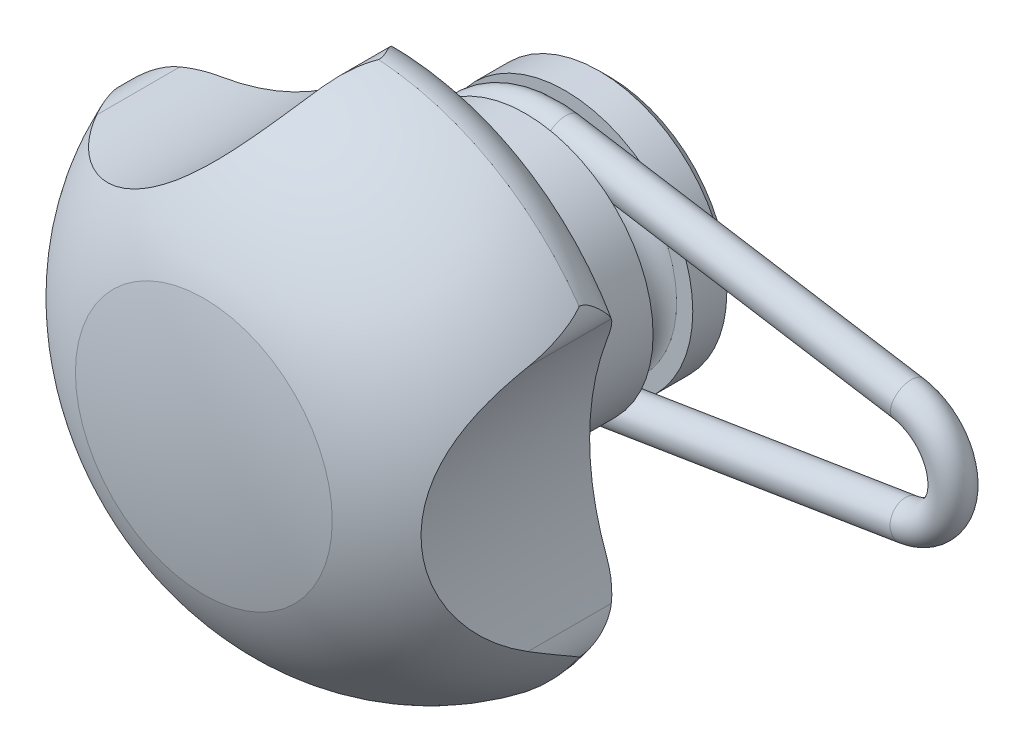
ISO-10303-21;
HEADER;
FILE_DESCRIPTION(('STEP AP214'),'2;1');
FILE_NAME('part.step','',(''),(''),'','','');
FILE_SCHEMA(('AUTOMOTIVE_DESIGN { 1 0 10303 214 1 1 1 1 }'));
ENDSEC;
DATA;
#1=APPLICATION_CONTEXT('core data for automotive mechanical design processes');
#2=APPLICATION_PROTOCOL_DEFINITION('international standard','automotive_design',2000,#1);
#3=PRODUCT_CONTEXT('',#1,'mechanical');
#4=PRODUCT('Part','Part','',(#3));
#5=PRODUCT_RELATED_PRODUCT_CATEGORY('part','',(#4));
#6=PRODUCT_DEFINITION_FORMATION('','',#4);
#7=PRODUCT_DEFINITION_CONTEXT('part definition',#1,'design');
#8=PRODUCT_DEFINITION('design','',#6,#7);
#9=PRODUCT_DEFINITION_SHAPE('','',#8);
#10=(LENGTH_UNIT() NAMED_UNIT(*) SI_UNIT(.MILLI.,.METRE.));
#11=(NAMED_UNIT(*) PLANE_ANGLE_UNIT() SI_UNIT($,.RADIAN.));
#12=(NAMED_UNIT(*) SI_UNIT($,.STERADIAN.) SOLID_ANGLE_UNIT());
#13=UNCERTAINTY_MEASURE_WITH_UNIT(LENGTH_MEASURE(1.E-05),#10,'distance_accuracy_value','');
#14=(GEOMETRIC_REPRESENTATION_CONTEXT(3) GLOBAL_UNCERTAINTY_ASSIGNED_CONTEXT((#13)) GLOBAL_UNIT_ASSIGNED_CONTEXT((#10,
#11,#12)) REPRESENTATION_CONTEXT('',''));
#15=CARTESIAN_POINT('',(0.,0.,0.));
#16=DIRECTION('',(0.,0.,1.));
#17=DIRECTION('',(1.,0.,0.));
#18=AXIS2_PLACEMENT_3D('',#15,#16,#17);
#19=CARTESIAN_POINT('',(0.,0.,3.33333333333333));
#20=DIRECTION('',(0.,0.,1.));
#21=DIRECTION('',(0.,1.,0.));
#22=AXIS2_PLACEMENT_3D('',#19,#20,#21);
#23=TOROIDAL_SURFACE('',#22,5.43685897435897,0.95352564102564);
#24=CARTESIAN_POINT('',(0.,0.,4.26666666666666));
#25=DIRECTION('',(0.,0.,1.));
#26=DIRECTION('',(0.,1.,0.));
#27=AXIS2_PLACEMENT_3D('',#24,#25,#26);
#28=CIRCLE('',#27,5.24166666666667);
#29=CARTESIAN_POINT('',(0.,5.24166666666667,4.26666666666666));
#30=VERTEX_POINT('',#29);
#31=EDGE_CURVE('E423',#30,#30,#28,.T.);
#32=ORIENTED_EDGE('',*,*,#31,.F.);
#33=EDGE_LOOP('',(#32));
#34=FACE_BOUND('',#33,.T.);
#35=CARTESIAN_POINT('',(0.,0.,2.54236949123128));
#36=DIRECTION('',(0.,0.,-1.));
#37=DIRECTION('',(0.,-1.,0.));
#38=AXIS2_PLACEMENT_3D('',#35,#36,#37);
#39=CIRCLE('',#38,4.90432977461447);
#40=CARTESIAN_POINT('',(0.784701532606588,-4.84114594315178,2.54236949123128));
#41=VERTEX_POINT('',#40);
#42=CARTESIAN_POINT('',(0.784701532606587,4.84114594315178,2.54236949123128));
#43=VERTEX_POINT('',#42);
#44=EDGE_CURVE('E574',#41,#43,#39,.T.);
#45=ORIENTED_EDGE('',*,*,#44,.T.);
#46=CARTESIAN_POINT('',(0.693141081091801,4.85424150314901,4.12372363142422));
#47=CARTESIAN_POINT('',(0.743001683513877,4.84802167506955,4.12431582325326));
#48=CARTESIAN_POINT('',(0.792697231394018,4.8403420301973,4.12445310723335));
#49=CARTESIAN_POINT('',(0.891688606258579,4.82192459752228,4.12368628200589));
#50=CARTESIAN_POINT('',(0.940982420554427,4.81117618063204,4.12277851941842));
#51=CARTESIAN_POINT('',(1.03974031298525,4.78627447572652,4.11975362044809));
#52=CARTESIAN_POINT('',(1.08918751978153,4.77205647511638,4.1176122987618));
#53=CARTESIAN_POINT('',(1.18671654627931,4.73994821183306,4.11164704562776));
#54=CARTESIAN_POINT('',(1.23480039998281,4.72206378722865,4.10782577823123));
#55=CARTESIAN_POINT('',(1.32172833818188,4.68501333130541,4.09839477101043));
#56=CARTESIAN_POINT('',(1.36086605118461,4.66645516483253,4.09314510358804));
#57=CARTESIAN_POINT('',(1.4366670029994,4.62579008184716,4.07988620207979));
#58=CARTESIAN_POINT('',(1.47333803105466,4.60369516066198,4.07188619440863));
#59=CARTESIAN_POINT('',(1.53767991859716,4.55925734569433,4.05323360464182));
#60=CARTESIAN_POINT('',(1.5658758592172,4.53744825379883,4.0431585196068));
#61=CARTESIAN_POINT('',(1.61827547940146,4.49141992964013,4.01895781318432));
#62=CARTESIAN_POINT('',(1.64248681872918,4.46720546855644,4.00484010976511));
#63=CARTESIAN_POINT('',(1.68605179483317,4.41732930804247,3.97158198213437));
#64=CARTESIAN_POINT('',(1.70535968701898,4.39165653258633,3.95239743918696));
#65=CARTESIAN_POINT('',(1.73855619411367,4.34105649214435,3.90897267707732));
#66=CARTESIAN_POINT('',(1.75243933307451,4.31613000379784,3.88472738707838));
#67=CARTESIAN_POINT('',(1.77402704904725,4.27204287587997,3.83534356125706));
#68=CARTESIAN_POINT('',(1.78230220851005,4.25255450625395,3.81073651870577));
#69=CARTESIAN_POINT('',(1.79613226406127,4.21642219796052,3.75883219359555));
#70=CARTESIAN_POINT('',(1.80168668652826,4.19977875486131,3.73153444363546));
#71=CARTESIAN_POINT('',(1.8114640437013,4.16772777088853,3.67081317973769));
#72=CARTESIAN_POINT('',(1.81538503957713,4.15283310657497,3.63707072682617));
#73=CARTESIAN_POINT('',(1.82148034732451,4.12786674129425,3.56769642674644));
#74=CARTESIAN_POINT('',(1.82365373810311,4.11779758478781,3.53206359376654));
#75=CARTESIAN_POINT('',(1.82699426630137,4.10168407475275,3.45475881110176));
#76=CARTESIAN_POINT('',(1.82798434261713,4.09637338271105,3.41292463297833));
#77=CARTESIAN_POINT('',(1.8287322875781,4.09240698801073,3.32892462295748));
#78=CARTESIAN_POINT('',(1.8284897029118,4.09375373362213,3.28675867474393));
#79=CARTESIAN_POINT('',(1.82664760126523,4.10328553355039,3.20130418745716));
#80=CARTESIAN_POINT('',(1.82498759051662,4.1117751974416,3.15805036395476));
#81=CARTESIAN_POINT('',(1.81962792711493,4.13576787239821,3.07362604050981));
#82=CARTESIAN_POINT('',(1.81592718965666,4.15127461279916,3.03245666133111));
#83=CARTESIAN_POINT('',(1.80539978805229,4.1883640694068,2.95439105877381));
#84=CARTESIAN_POINT('',(1.79863815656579,4.20981694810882,2.91742501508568));
#85=CARTESIAN_POINT('',(1.78031979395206,4.25779008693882,2.84831041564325));
#86=CARTESIAN_POINT('',(1.76877411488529,4.28429859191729,2.81615098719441));
#87=CARTESIAN_POINT('',(1.74097302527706,4.33670334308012,2.76167248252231));
#88=CARTESIAN_POINT('',(1.72550105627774,4.36225052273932,2.73862258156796));
#89=CARTESIAN_POINT('',(1.68899681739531,4.41349884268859,2.69772483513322));
#90=CARTESIAN_POINT('',(1.66796974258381,4.43919981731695,2.67987216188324));
#91=CARTESIAN_POINT('',(1.62426180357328,4.48540307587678,2.65117153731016));
#92=CARTESIAN_POINT('',(1.60221722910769,4.50613137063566,2.6396948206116));
#93=CARTESIAN_POINT('',(1.55526174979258,4.54566943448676,2.6196967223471));
#94=CARTESIAN_POINT('',(1.53034852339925,4.56447762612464,2.61117775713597));
#95=CARTESIAN_POINT('',(1.48042417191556,4.59863212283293,2.59697473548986));
#96=CARTESIAN_POINT('',(1.45556256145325,4.61413260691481,2.5911251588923));
#97=CARTESIAN_POINT('',(1.4045423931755,4.64340504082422,2.58089831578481));
#98=CARTESIAN_POINT('',(1.37838277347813,4.65717554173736,2.57652227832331));
#99=CARTESIAN_POINT('',(1.29818958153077,4.69625917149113,2.56498899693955));
#100=CARTESIAN_POINT('',(1.24273615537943,4.71915217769,2.55949822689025));
#101=CARTESIAN_POINT('',(1.14611804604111,4.75379218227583,2.55232326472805));
#102=CARTESIAN_POINT('',(1.10543842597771,4.76685031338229,2.5499981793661));
#103=CARTESIAN_POINT('',(1.02331569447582,4.79057840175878,2.54633971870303));
#104=CARTESIAN_POINT('',(0.981872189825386,4.80124708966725,2.54500686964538));
#105=CARTESIAN_POINT('',(0.899383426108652,4.82014986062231,2.54315625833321));
#106=CARTESIAN_POINT('',(0.858349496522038,4.8284323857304,2.54262119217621));
#107=CARTESIAN_POINT('',(0.775964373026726,4.84289690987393,2.54226229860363));
#108=CARTESIAN_POINT('',(0.734613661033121,4.84908162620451,2.54243754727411));
#109=CARTESIAN_POINT('',(0.693141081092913,4.85424150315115,2.54294303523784));
#110=B_SPLINE_CURVE_WITH_KNOTS('',3,(#46,#47,#48,#49,#50,#51,#52,#53,#54,#55,#56,#57,#58,#59,
#60,#61,#62,#63,#64,#65,#66,#67,#68,#69,#70,#71,#72,#73,#74,#75,#76,#77,#78,#79,#80,#81,#82,#83,
#84,#85,#86,#87,#88,#89,#90,#91,#92,#93,#94,#95,#96,#97,#98,#99,#100,#101,#102,#103,#104,#105,
#106,#107,#108,#109),.UNSPECIFIED.,.F.,.F.,(4,2,2,2,2,2,2,2,2,2,2,2,2,2,2,2,2,2,2,2,2,2,2,2,2,2,
2,2,2,2,2,4),(0.,0.150744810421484,0.302018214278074,0.456363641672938,0.61046518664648,
0.741146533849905,0.871393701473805,0.982113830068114,1.09261856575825,1.20411918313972,
1.31573206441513,1.4127482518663,1.50978132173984,1.62062203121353,1.73152112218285,
1.8575032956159,1.9835318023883,2.11522432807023,2.24698692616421,2.3760726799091,
2.50486186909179,2.6173102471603,2.72965383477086,2.82637943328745,2.9231838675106,
3.01267676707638,3.1022441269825,3.28244425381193,3.41073967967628,3.53910310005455,
3.66463962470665,3.79001291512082),.UNSPECIFIED.);
#111=CARTESIAN_POINT('',(0.784701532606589,4.84114594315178,4.12429717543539));
#112=VERTEX_POINT('',#111);
#113=EDGE_CURVE('E222',#112,#43,#110,.T.);
#114=ORIENTED_EDGE('',*,*,#113,.F.);
#115=CARTESIAN_POINT('',(0.,0.,4.12429717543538));
#116=DIRECTION('',(0.,0.,1.));
#117=DIRECTION('',(0.,1.,0.));
#118=AXIS2_PLACEMENT_3D('',#115,#116,#117);
#119=CIRCLE('',#118,4.90432977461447);
#120=CARTESIAN_POINT('',(0.784701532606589,-4.84114594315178,4.12429717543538));
#121=VERTEX_POINT('',#120);
#122=EDGE_CURVE('E133',#112,#121,#119,.T.);
#123=ORIENTED_EDGE('',*,*,#122,.T.);
#124=CARTESIAN_POINT('',(0.693141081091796,-4.85424150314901,2.54294303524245));
#125=CARTESIAN_POINT('',(0.743001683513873,-4.84802167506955,2.54235084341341));
#126=CARTESIAN_POINT('',(0.792697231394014,-4.8403420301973,2.54221355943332));
#127=CARTESIAN_POINT('',(0.891688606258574,-4.82192459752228,2.54298038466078));
#128=CARTESIAN_POINT('',(0.940982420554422,-4.81117618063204,2.54388814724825));
#129=CARTESIAN_POINT('',(1.03974031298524,-4.78627447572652,2.54691304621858));
#130=CARTESIAN_POINT('',(1.08918751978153,-4.77205647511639,2.54905436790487));
#131=CARTESIAN_POINT('',(1.18671654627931,-4.73994821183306,2.55501962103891));
#132=CARTESIAN_POINT('',(1.23480039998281,-4.72206378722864,2.55884088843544));
#133=CARTESIAN_POINT('',(1.32172833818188,-4.6850133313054,2.56827189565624));
#134=CARTESIAN_POINT('',(1.36086605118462,-4.66645516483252,2.57352156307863));
#135=CARTESIAN_POINT('',(1.4366670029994,-4.62579008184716,2.58678046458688));
#136=CARTESIAN_POINT('',(1.47333803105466,-4.60369516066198,2.59478047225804));
#137=CARTESIAN_POINT('',(1.53767991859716,-4.55925734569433,2.61343306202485));
#138=CARTESIAN_POINT('',(1.56587585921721,-4.53744825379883,2.62350814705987));
#139=CARTESIAN_POINT('',(1.61827547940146,-4.49141992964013,2.64770885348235));
#140=CARTESIAN_POINT('',(1.64248681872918,-4.46720546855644,2.66182655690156));
#141=CARTESIAN_POINT('',(1.68605179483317,-4.41732930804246,2.69508468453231));
#142=CARTESIAN_POINT('',(1.70535968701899,-4.39165653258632,2.71426922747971));
#143=CARTESIAN_POINT('',(1.73855619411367,-4.34105649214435,2.75769398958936));
#144=CARTESIAN_POINT('',(1.75243933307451,-4.31613000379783,2.7819392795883));
#145=CARTESIAN_POINT('',(1.77402704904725,-4.27204287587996,2.83132310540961));
#146=CARTESIAN_POINT('',(1.78230220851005,-4.25255450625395,2.8559301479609));
#147=CARTESIAN_POINT('',(1.79613226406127,-4.21642219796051,2.90783447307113));
#148=CARTESIAN_POINT('',(1.80168668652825,-4.1997787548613,2.93513222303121));
#149=CARTESIAN_POINT('',(1.81146404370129,-4.16772777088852,2.99585348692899));
#150=CARTESIAN_POINT('',(1.81538503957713,-4.15283310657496,3.02959593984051));
#151=CARTESIAN_POINT('',(1.82148034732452,-4.12786674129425,3.09897023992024));
#152=CARTESIAN_POINT('',(1.82365373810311,-4.11779758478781,3.13460307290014));
#153=CARTESIAN_POINT('',(1.82699426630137,-4.10168407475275,3.21190785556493));
#154=CARTESIAN_POINT('',(1.82798434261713,-4.09637338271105,3.25374203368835));
#155=CARTESIAN_POINT('',(1.82873228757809,-4.09240698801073,3.3377420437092));
#156=CARTESIAN_POINT('',(1.8284897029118,-4.09375373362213,3.37990799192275));
#157=CARTESIAN_POINT('',(1.82664760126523,-4.10328553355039,3.46536247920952));
#158=CARTESIAN_POINT('',(1.82498759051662,-4.1117751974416,3.50861630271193));
#159=CARTESIAN_POINT('',(1.81962792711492,-4.13576787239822,3.59304062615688));
#160=CARTESIAN_POINT('',(1.81592718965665,-4.15127461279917,3.63421000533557));
#161=CARTESIAN_POINT('',(1.80539978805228,-4.18836406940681,3.71227560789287));
#162=CARTESIAN_POINT('',(1.79863815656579,-4.20981694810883,3.749241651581));
#163=CARTESIAN_POINT('',(1.78031979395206,-4.25779008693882,3.81835625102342));
#164=CARTESIAN_POINT('',(1.76877411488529,-4.2842985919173,3.85051567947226));
#165=CARTESIAN_POINT('',(1.74097302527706,-4.33670334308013,3.90499418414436));
#166=CARTESIAN_POINT('',(1.72550105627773,-4.36225052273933,3.92804408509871));
#167=CARTESIAN_POINT('',(1.6889968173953,-4.4134988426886,3.96894183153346));
#168=CARTESIAN_POINT('',(1.66796974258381,-4.43919981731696,3.98679450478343));
#169=CARTESIAN_POINT('',(1.62426180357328,-4.48540307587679,4.01549512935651));
#170=CARTESIAN_POINT('',(1.60221722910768,-4.50613137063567,4.02697184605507));
#171=CARTESIAN_POINT('',(1.55526174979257,-4.54566943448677,4.04696994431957));
#172=CARTESIAN_POINT('',(1.53034852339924,-4.56447762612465,4.0554889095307));
#173=CARTESIAN_POINT('',(1.48042417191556,-4.59863212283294,4.06969193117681));
#174=CARTESIAN_POINT('',(1.45556256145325,-4.61413260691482,4.07554150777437));
#175=CARTESIAN_POINT('',(1.4045423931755,-4.64340504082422,4.08576835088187));
#176=CARTESIAN_POINT('',(1.37838277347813,-4.65717554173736,4.09014438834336));
#177=CARTESIAN_POINT('',(1.29818958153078,-4.69625917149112,4.10167766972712));
#178=CARTESIAN_POINT('',(1.24273615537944,-4.71915217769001,4.10716843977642));
#179=CARTESIAN_POINT('',(1.14611804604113,-4.75379218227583,4.11434340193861));
#180=CARTESIAN_POINT('',(1.10543842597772,-4.76685031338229,4.11666848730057));
#181=CARTESIAN_POINT('',(1.02331569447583,-4.79057840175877,4.12032694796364));
#182=CARTESIAN_POINT('',(0.981872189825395,-4.80124708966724,4.12165979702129));
#183=CARTESIAN_POINT('',(0.899383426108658,-4.8201498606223,4.12351040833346));
#184=CARTESIAN_POINT('',(0.858349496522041,-4.8284323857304,4.12404547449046));
#185=CARTESIAN_POINT('',(0.775964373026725,-4.84289690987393,4.12440436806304));
#186=CARTESIAN_POINT('',(0.734613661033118,-4.84908162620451,4.12422911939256));
#187=CARTESIAN_POINT('',(0.693141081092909,-4.85424150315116,4.12372363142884));
#188=B_SPLINE_CURVE_WITH_KNOTS('',3,(#124,#125,#126,#127,#128,#129,#130,#131,#132,#133,#134,
#135,#136,#137,#138,#139,#140,#141,#142,#143,#144,#145,#146,#147,#148,#149,#150,#151,#152,#153,
#154,#155,#156,#157,#158,#159,#160,#161,#162,#163,#164,#165,#166,#167,#168,#169,#170,#171,#172,
#173,#174,#175,#176,#177,#178,#179,#180,#181,#182,#183,#184,#185,#186,#187),.UNSPECIFIED.,.F.,
.F.,(4,2,2,2,2,2,2,2,2,2,2,2,2,2,2,2,2,2,2,2,2,2,2,2,2,2,2,2,2,2,2,4),(0.,0.150744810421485,
0.302018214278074,0.456363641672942,0.610465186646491,0.741146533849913,0.871393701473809,
0.98211383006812,1.09261856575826,1.20411918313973,1.31573206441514,1.41274825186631,
1.50978132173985,1.62062203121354,1.73152112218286,1.85750329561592,1.98353180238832,
2.11522432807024,2.24698692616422,2.37607267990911,2.5048618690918,2.61731024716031,
2.72965383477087,2.82637943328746,2.92318386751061,3.01267676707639,3.1022441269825,
3.28244425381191,3.41073967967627,3.53910310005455,3.66463962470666,3.79001291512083),.UNSPECIFIED.);
#189=EDGE_CURVE('E129',#41,#121,#188,.T.);
#190=ORIENTED_EDGE('',*,*,#189,.F.);
#191=EDGE_LOOP('',(#45,#114,#123,#190));
#192=FACE_BOUND('',#191,.T.);
#193=CARTESIAN_POINT('',(0.,0.,2.4));
#194=DIRECTION('',(0.,0.,1.));
#195=DIRECTION('',(0.,1.,0.));
#196=AXIS2_PLACEMENT_3D('',#193,#194,#195);
#197=CIRCLE('',#196,5.24166666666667);
#198=CARTESIAN_POINT('',(0.,5.24166666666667,2.4));
#199=VERTEX_POINT('',#198);
#200=EDGE_CURVE('E426',#199,#199,#197,.T.);
#201=ORIENTED_EDGE('',*,*,#200,.T.);
#202=EDGE_LOOP('',(#201));
#203=FACE_BOUND('',#202,.T.);
#204=ADVANCED_FACE('F14',(#34,#192,#203),#23,.F.);
#205=CARTESIAN_POINT('',(0.,0.,12.));
#206=DIRECTION('',(0.,0.,1.));
#207=DIRECTION('',(0.,1.,0.));
#208=AXIS2_PLACEMENT_3D('',#205,#206,#207);
#209=TOROIDAL_SURFACE('',#208,10.5,2.);
#210=CARTESIAN_POINT('',(0.,0.,10.));
#211=DIRECTION('',(0.,0.,1.));
#212=DIRECTION('',(0.,1.,0.));
#213=AXIS2_PLACEMENT_3D('',#210,#211,#212);
#214=CIRCLE('',#213,10.5);
#215=CARTESIAN_POINT('',(9.54264705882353,4.38039805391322,10.));
#216=VERTEX_POINT('',#215);
#217=CARTESIAN_POINT('',(-0.977787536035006,10.4543737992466,10.));
#218=VERTEX_POINT('',#217);
#219=EDGE_CURVE('E411',#216,#218,#214,.T.);
#220=ORIENTED_EDGE('',*,*,#219,.T.);
#221=CARTESIAN_POINT('',(-10.1034328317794,5.91392586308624,10.4052748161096));
#222=CARTESIAN_POINT('',(-10.0426477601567,5.91645967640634,10.366533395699));
#223=CARTESIAN_POINT('',(-9.98004494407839,5.91952367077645,10.3307983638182));
#224=CARTESIAN_POINT('',(-9.85198799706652,5.92680099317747,10.2652593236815));
#225=CARTESIAN_POINT('',(-9.78653844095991,5.93101253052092,10.2354461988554));
#226=CARTESIAN_POINT('',(-9.58826012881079,5.94540948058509,10.1551927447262));
#227=CARTESIAN_POINT('',(-9.45213994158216,5.95740892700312,10.1130972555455));
#228=CARTESIAN_POINT('',(-9.13357319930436,5.99100868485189,10.0395648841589));
#229=CARTESIAN_POINT('',(-8.94970847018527,6.01442400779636,10.0153429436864));
#230=CARTESIAN_POINT('',(-8.58146480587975,6.06979631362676,9.99536562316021));
#231=CARTESIAN_POINT('',(-8.39708626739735,6.10178228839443,9.99970806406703));
#232=CARTESIAN_POINT('',(-8.06120890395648,6.16778523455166,10.0281329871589));
#233=CARTESIAN_POINT('',(-7.90916869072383,6.20065874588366,10.0489464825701));
#234=CARTESIAN_POINT('',(-7.60846043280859,6.27149554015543,10.1028336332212));
#235=CARTESIAN_POINT('',(-7.45979435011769,6.309461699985,10.1359142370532));
#236=CARTESIAN_POINT('',(-7.16463270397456,6.39056506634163,10.2116376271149));
#237=CARTESIAN_POINT('',(-7.01817672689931,6.43375271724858,10.2543778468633));
#238=CARTESIAN_POINT('',(-6.72891762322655,6.52476088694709,10.3461936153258));
#239=CARTESIAN_POINT('',(-6.58611175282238,6.57257778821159,10.3952642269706));
#240=CARTESIAN_POINT('',(-6.27723620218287,6.68217801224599,10.5061791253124));
#241=CARTESIAN_POINT('',(-6.11175182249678,6.74490839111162,10.568706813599));
#242=CARTESIAN_POINT('',(-5.86510854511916,6.84443723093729,10.6615612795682));
#243=CARTESIAN_POINT('',(-5.78305278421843,6.8785667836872,10.6923959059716));
#244=CARTESIAN_POINT('',(-5.61926690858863,6.94875763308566,10.7526904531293));
#245=CARTESIAN_POINT('',(-5.53753675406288,6.9848186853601,10.7821505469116));
#246=CARTESIAN_POINT('',(-5.37636451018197,7.05802154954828,10.8376626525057));
#247=CARTESIAN_POINT('',(-5.29692148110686,7.0951061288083,10.8637862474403));
#248=CARTESIAN_POINT('',(-5.1378338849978,7.17144195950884,10.9120735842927));
#249=CARTESIAN_POINT('',(-5.05818930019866,7.21069340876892,10.9342369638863));
#250=CARTESIAN_POINT('',(-4.89902692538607,7.29128270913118,10.9727526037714));
#251=CARTESIAN_POINT('',(-4.819510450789,7.33260930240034,10.9891330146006));
#252=CARTESIAN_POINT('',(-4.66047954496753,7.41747651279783,11.0144514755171));
#253=CARTESIAN_POINT('',(-4.58096514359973,7.46101572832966,11.0233941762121));
#254=CARTESIAN_POINT('',(-4.44740934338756,7.53605938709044,11.0312069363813));
#255=CARTESIAN_POINT('',(-4.39320799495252,7.56705072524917,11.0323578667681));
#256=CARTESIAN_POINT('',(-4.28532455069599,7.62981316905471,11.0305515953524));
#257=CARTESIAN_POINT('',(-4.23164249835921,7.66158433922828,11.0275940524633));
#258=CARTESIAN_POINT('',(-4.07153967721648,7.75796272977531,11.0127794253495));
#259=CARTESIAN_POINT('',(-3.96623304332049,7.82353880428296,10.9949710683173));
#260=CARTESIAN_POINT('',(-3.75731549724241,7.95790955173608,10.9469793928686));
#261=CARTESIAN_POINT('',(-3.65379773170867,8.02674351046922,10.916523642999));
#262=CARTESIAN_POINT('',(-3.45059298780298,8.16619136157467,10.8481740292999));
#263=CARTESIAN_POINT('',(-3.35090594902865,8.23680522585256,10.8102802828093));
#264=CARTESIAN_POINT('',(-3.1568779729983,8.37850741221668,10.7317321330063));
#265=CARTESIAN_POINT('',(-3.06246678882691,8.4495473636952,10.691161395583));
#266=CARTESIAN_POINT('',(-2.87593862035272,8.59406607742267,10.6090567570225));
#267=CARTESIAN_POINT('',(-2.7838220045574,8.66754522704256,10.5675227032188));
#268=CARTESIAN_POINT('',(-2.60134159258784,8.81738110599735,10.4853968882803));
#269=CARTESIAN_POINT('',(-2.51097971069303,8.89374073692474,10.4448061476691));
#270=CARTESIAN_POINT('',(-2.33181800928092,9.04957896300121,10.3662303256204));
#271=CARTESIAN_POINT('',(-2.24301815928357,9.1290574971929,10.3282451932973));
#272=CARTESIAN_POINT('',(-2.06838167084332,9.28996613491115,10.2569868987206));
#273=CARTESIAN_POINT('',(-1.9825203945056,9.37133704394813,10.2236424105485));
#274=CARTESIAN_POINT('',(-1.81219068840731,9.53745542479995,10.1622830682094));
#275=CARTESIAN_POINT('',(-1.72772251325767,9.62220350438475,10.1342691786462));
#276=CARTESIAN_POINT('',(-1.47698673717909,9.88123073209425,10.0605066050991));
#277=CARTESIAN_POINT('',(-1.31277053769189,10.0608590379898,10.0247652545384));
#278=CARTESIAN_POINT('',(-1.10175585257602,10.3058737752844,10.0038726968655));
#279=CARTESIAN_POINT('',(-1.05073671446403,10.3662656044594,10.0008531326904));
#280=CARTESIAN_POINT('',(-0.949821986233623,10.4880426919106,9.99945880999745));
#281=CARTESIAN_POINT('',(-0.899926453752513,10.5494280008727,10.0010842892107));
#282=CARTESIAN_POINT('',(-0.751809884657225,10.7352363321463,10.0137077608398));
#283=CARTESIAN_POINT('',(-0.655560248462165,10.8608457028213,10.0325000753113));
#284=CARTESIAN_POINT('',(-0.46950485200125,11.1132753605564,10.095267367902));
#285=CARTESIAN_POINT('',(-0.379784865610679,11.2400931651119,10.1395264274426));
#286=CARTESIAN_POINT('',(-0.253501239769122,11.4253858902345,10.2271121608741));
#287=CARTESIAN_POINT('',(-0.212853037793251,11.4862261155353,10.2597650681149));
#288=CARTESIAN_POINT('',(-0.134618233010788,11.6054708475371,10.3323233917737));
#289=CARTESIAN_POINT('',(-0.0970287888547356,11.66387758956,10.3722219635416));
#290=CARTESIAN_POINT('',(-0.040750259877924,11.752842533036,10.4405428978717));
#291=CARTESIAN_POINT('',(-0.0208904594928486,11.7845659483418,10.4665123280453));
#292=CARTESIAN_POINT('',(0.0176544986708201,11.8467265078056,10.520798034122));
#293=CARTESIAN_POINT('',(0.036339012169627,11.8771629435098,10.5491155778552));
#294=CARTESIAN_POINT('',(0.0543998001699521,11.9068548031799,10.5785887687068));
#295=B_SPLINE_CURVE_WITH_KNOTS('',3,(#221,#222,#223,#224,#225,#226,#227,#228,#229,#230,#231,
#232,#233,#234,#235,#236,#237,#238,#239,#240,#241,#242,#243,#244,#245,#246,#247,#248,#249,#250,
#251,#252,#253,#254,#255,#256,#257,#258,#259,#260,#261,#262,#263,#264,#265,#266,#267,#268,#269,
#270,#271,#272,#273,#274,#275,#276,#277,#278,#279,#280,#281,#282,#283,#284,#285,#286,#287,#288,
#289,#290,#291,#292,#293,#294),.UNSPECIFIED.,.F.,.F.,(4,2,2,2,2,2,2,2,2,2,2,2,2,2,2,2,2,2,2,2,2,
2,2,2,2,2,2,2,2,2,2,2,2,2,2,2,4),(0.,0.216185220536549,0.432035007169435,0.859000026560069,
1.41675409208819,1.97641922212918,2.44655346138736,2.91695441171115,3.39233053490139,
3.86733812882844,4.43024740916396,4.71243376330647,4.99458449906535,5.26895395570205,
5.54334850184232,5.81638830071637,6.08925724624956,6.2764590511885,6.46367639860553,
6.83869468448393,7.22224846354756,7.6057961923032,7.98051168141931,8.35528696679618,
8.73045042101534,9.10560654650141,9.47414195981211,9.84274399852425,10.5773184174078,
10.8145433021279,11.051780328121,11.5280907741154,12.0098204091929,12.2498506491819,
12.4896553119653,12.6262342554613,12.7628874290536),.UNSPECIFIED.);
#296=CARTESIAN_POINT('',(0.0542781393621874,11.9066548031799,10.5783902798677));
#297=VERTEX_POINT('',#296);
#298=EDGE_CURVE('E509',#218,#297,#295,.T.);
#299=ORIENTED_EDGE('',*,*,#298,.T.);
#300=CARTESIAN_POINT('',(0.830100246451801,12.4724068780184,12.0002));
#301=CARTESIAN_POINT('',(0.830145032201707,12.4724102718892,11.9771892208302));
#302=CARTESIAN_POINT('',(0.828818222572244,12.4720989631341,11.9542126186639));
#303=CARTESIAN_POINT('',(0.823740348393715,12.4708654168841,11.9086454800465));
#304=CARTESIAN_POINT('',(0.820000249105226,12.4699459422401,11.8860536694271));
#305=CARTESIAN_POINT('',(0.805785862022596,12.4663419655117,11.8198165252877));
#306=CARTESIAN_POINT('',(0.792295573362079,12.4628104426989,11.7768746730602));
#307=CARTESIAN_POINT('',(0.758574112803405,12.4530967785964,11.6885942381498));
#308=CARTESIAN_POINT('',(0.737757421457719,12.4466621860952,11.6435254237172));
#309=CARTESIAN_POINT('',(0.692870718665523,12.4312138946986,11.5554632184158));
#310=CARTESIAN_POINT('',(0.668795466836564,12.422196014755,11.5124733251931));
#311=CARTESIAN_POINT('',(0.618459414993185,12.4013497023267,11.427183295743));
#312=CARTESIAN_POINT('',(0.592162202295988,12.3894638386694,11.3849191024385));
#313=CARTESIAN_POINT('',(0.538850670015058,12.3629482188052,11.3017205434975));
#314=CARTESIAN_POINT('',(0.511836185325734,12.3483178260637,11.2607864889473));
#315=CARTESIAN_POINT('',(0.445100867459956,12.30875535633,11.1611932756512));
#316=CARTESIAN_POINT('',(0.405342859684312,12.2822044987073,11.1031921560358));
#317=CARTESIAN_POINT('',(0.327175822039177,12.2228526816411,10.989526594));
#318=CARTESIAN_POINT('',(0.288766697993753,12.1900521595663,10.9338619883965));
#319=CARTESIAN_POINT('',(0.215567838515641,12.1190105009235,10.8266156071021));
#320=CARTESIAN_POINT('',(0.180705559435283,12.0809541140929,10.7749623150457));
#321=CARTESIAN_POINT('',(0.114486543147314,11.9984992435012,10.6743867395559));
#322=CARTESIAN_POINT('',(0.0831359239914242,11.9540899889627,10.6254692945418));
#323=CARTESIAN_POINT('',(0.0541565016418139,11.9064548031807,10.5781918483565));
#324=B_SPLINE_CURVE_WITH_KNOTS('',3,(#300,#301,#302,#303,#304,#305,#306,#307,#308,#309,#310,
#311,#312,#313,#314,#315,#316,#317,#318,#319,#320,#321,#322,#323),.UNSPECIFIED.,.F.,.F.,(4,2,2,
2,2,2,2,2,2,2,2,4),(0.,0.0689349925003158,0.137558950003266,0.272350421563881,0.422229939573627,
0.572353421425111,0.725777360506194,0.879236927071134,1.10442488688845,1.3295970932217,
1.54825811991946,1.76729436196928),.UNSPECIFIED.);
#325=CARTESIAN_POINT('',(0.830100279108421,12.4724068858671,12.));
#326=VERTEX_POINT('',#325);
#327=EDGE_CURVE('E520',#326,#297,#324,.T.);
#328=ORIENTED_EDGE('',*,*,#327,.F.);
#329=CARTESIAN_POINT('',(0.,0.,12.));
#330=DIRECTION('',(0.,0.,1.));
#331=DIRECTION('',(0.,1.,0.));
#332=AXIS2_PLACEMENT_3D('',#329,#330,#331);
#333=CIRCLE('',#332,12.5);
#334=CARTESIAN_POINT('',(10.2613005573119,7.13832689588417,12.0000000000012));
#335=VERTEX_POINT('',#334);
#336=EDGE_CURVE('E407',#335,#326,#333,.T.);
#337=ORIENTED_EDGE('',*,*,#336,.F.);
#338=CARTESIAN_POINT('',(10.1731289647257,5.7924889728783,10.4050035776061));
#339=CARTESIAN_POINT('',(10.2010616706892,5.84589763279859,10.4433725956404));
#340=CARTESIAN_POINT('',(10.2255467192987,5.899738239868,10.4835133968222));
#341=CARTESIAN_POINT('',(10.2680505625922,6.00752552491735,10.5667694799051));
#342=CARTESIAN_POINT('',(10.2860802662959,6.06147186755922,10.6098795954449));
#343=CARTESIAN_POINT('',(10.3161308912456,6.16867297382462,10.698452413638));
#344=CARTESIAN_POINT('',(10.3281767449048,6.22192969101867,10.7439044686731));
#345=CARTESIAN_POINT('',(10.3468471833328,6.32746201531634,10.8370308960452));
#346=CARTESIAN_POINT('',(10.3534699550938,6.3797372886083,10.8847060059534));
#347=CARTESIAN_POINT('',(10.361407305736,6.47828778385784,10.9778614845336));
#348=CARTESIAN_POINT('',(10.3631322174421,6.52469033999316,11.0231739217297));
#349=CARTESIAN_POINT('',(10.3628477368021,6.61577969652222,11.1154924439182));
#350=CARTESIAN_POINT('',(10.3608378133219,6.66046625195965,11.1624987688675));
#351=CARTESIAN_POINT('',(10.3535544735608,6.74752101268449,11.2583565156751));
#352=CARTESIAN_POINT('',(10.3482813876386,6.78988945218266,11.3072077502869));
#353=CARTESIAN_POINT('',(10.3351197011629,6.87138577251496,11.4071789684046));
#354=CARTESIAN_POINT('',(10.3272332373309,6.91051626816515,11.458297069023));
#355=CARTESIAN_POINT('',(10.3120831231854,6.97484922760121,11.5509548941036));
#356=CARTESIAN_POINT('',(10.3051351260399,7.00112350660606,11.5917974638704));
#357=CARTESIAN_POINT('',(10.2913134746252,7.04922552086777,11.6760794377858));
#358=CARTESIAN_POINT('',(10.2844397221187,7.07106006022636,11.7195147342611));
#359=CARTESIAN_POINT('',(10.2742597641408,7.10179713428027,11.7960609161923));
#360=CARTESIAN_POINT('',(10.270503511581,7.11261353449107,11.8283164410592));
#361=CARTESIAN_POINT('',(10.2647173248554,7.12898487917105,11.8942399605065));
#362=CARTESIAN_POINT('',(10.2626794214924,7.13456412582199,11.9279006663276));
#363=CARTESIAN_POINT('',(10.2614600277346,7.13788858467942,11.9745662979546));
#364=CARTESIAN_POINT('',(10.2612900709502,7.1383486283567,11.9873824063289));
#365=CARTESIAN_POINT('',(10.2613005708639,7.13832685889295,12.0002000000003));
#366=B_SPLINE_CURVE_WITH_KNOTS('',3,(#338,#339,#340,#341,#342,#343,#344,#345,#346,#347,#348,
#349,#350,#351,#352,#353,#354,#355,#356,#357,#358,#359,#360,#361,#362,#363,#364,#365),
.UNSPECIFIED.,.F.,.F.,(4,2,2,2,2,2,2,2,2,2,2,2,2,4),(0.,0.214133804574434,0.427904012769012,
0.640775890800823,0.853718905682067,1.04820512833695,1.24271901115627,1.43721320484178,
1.63154876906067,1.77858161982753,1.92538740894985,2.02774864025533,2.12963249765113,
2.16807780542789),.UNSPECIFIED.);
#367=CARTESIAN_POINT('',(10.173233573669,5.7926889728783,10.4051472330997));
#368=VERTEX_POINT('',#367);
#369=EDGE_CURVE('E522',#368,#335,#366,.T.);
#370=ORIENTED_EDGE('',*,*,#369,.F.);
#371=CARTESIAN_POINT('',(10.1733381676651,5.7928889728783,10.4052909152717));
#372=CARTESIAN_POINT('',(10.1451403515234,5.73898162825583,10.3665490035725));
#373=CARTESIAN_POINT('',(10.116492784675,5.68323496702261,10.3308134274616));
#374=CARTESIAN_POINT('',(10.0587672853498,5.56869762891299,10.265273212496));
#375=CARTESIAN_POINT('',(10.029690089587,5.50991180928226,10.2354594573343));
#376=CARTESIAN_POINT('',(9.94301987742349,5.33100210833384,10.1552040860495));
#377=CARTESIAN_POINT('',(9.88535205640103,5.20712069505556,10.1131071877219));
#378=CARTESIAN_POINT('',(9.75516823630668,4.91443918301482,10.0395716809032));
#379=CARTESIAN_POINT('',(9.68351488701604,4.74350341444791,10.0153477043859));
#380=CARTESIAN_POINT('',(9.54734778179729,4.3969150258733,9.9953658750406));
#381=CARTESIAN_POINT('',(9.4828593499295,4.22124824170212,9.99970591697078));
#382=CARTESIAN_POINT('',(9.372081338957,3.89737438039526,10.0281262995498));
#383=CARTESIAN_POINT('',(9.32453079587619,3.7492702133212,10.0489375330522));
#384=CARTESIAN_POINT('',(9.23552340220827,3.45343726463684,10.1028200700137));
#385=CARTESIAN_POINT('',(9.19407002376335,3.30570874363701,10.1358983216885));
#386=CARTESIAN_POINT('',(9.1167271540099,3.00954816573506,10.2116164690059));
#387=CARTESIAN_POINT('',(9.08090104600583,2.86112515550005,10.2543536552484));
#388=CARTESIAN_POINT('',(9.01508705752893,2.56512616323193,10.3461634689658));
#389=CARTESIAN_POINT('',(8.98509467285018,2.41754961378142,10.3952311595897));
#390=CARTESIAN_POINT('',(8.92557431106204,2.09527519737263,10.5061375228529));
#391=CARTESIAN_POINT('',(8.89715874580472,1.92061071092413,10.5686594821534));
#392=CARTESIAN_POINT('',(8.86003155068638,1.65726921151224,10.6615069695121));
#393=CARTESIAN_POINT('',(8.84856057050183,1.56914963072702,10.6923395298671));
#394=CARTESIAN_POINT('',(8.82745407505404,1.39222692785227,10.7526308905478));
#395=CARTESIAN_POINT('',(8.8178183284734,1.30342389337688,10.7820898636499));
#396=CARTESIAN_POINT('',(8.80062592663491,1.12725295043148,10.8376031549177));
#397=CARTESIAN_POINT('',(8.79301936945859,1.0399127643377,10.8637288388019));
#398=CARTESIAN_POINT('',(8.77958179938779,0.863974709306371,10.9120216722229));
#399=CARTESIAN_POINT('',(8.77375094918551,0.775376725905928,10.9341884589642));
#400=CARTESIAN_POINT('',(8.76395941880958,0.597247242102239,10.9727124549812));
#401=CARTESIAN_POINT('',(8.75998965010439,0.507722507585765,10.989097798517));
#402=CARTESIAN_POINT('',(8.75396843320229,0.327567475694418,11.0144275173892));
#403=CARTESIAN_POINT('',(8.75191578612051,0.236937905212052,11.0233765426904));
#404=CARTESIAN_POINT('',(8.75012502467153,0.0837581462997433,11.0312004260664));
#405=CARTESIAN_POINT('',(8.74986255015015,0.0213261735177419,11.0323561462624));
#406=CARTESIAN_POINT('',(8.75027242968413,-0.103478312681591,11.030559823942));
#407=CARTESIAN_POINT('',(8.75094486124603,-0.165850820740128,11.0276074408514));
#408=CARTESIAN_POINT('',(8.75435591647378,-0.352684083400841,11.0128083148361));
#409=CARTESIAN_POINT('',(8.75849053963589,-0.476664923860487,10.9950103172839));
#410=CARTESIAN_POINT('',(8.77039354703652,-0.724742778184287,10.9470424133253));
#411=CARTESIAN_POINT('',(8.77824179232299,-0.848779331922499,10.9166024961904));
#412=CARTESIAN_POINT('',(8.79739353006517,-1.09442560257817,10.8482842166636));
#413=CARTESIAN_POINT('',(8.80869697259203,-1.21603535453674,10.8104059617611));
#414=CARTESIAN_POINT('',(8.83438120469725,-1.4548157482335,10.7319019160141));
#415=CARTESIAN_POINT('',(8.84868373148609,-1.57202365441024,10.6913612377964));
#416=CARTESIAN_POINT('',(8.88054361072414,-1.8056711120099,10.6093141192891));
#417=CARTESIAN_POINT('',(8.89810148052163,-1.92211053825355,10.5678075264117));
#418=CARTESIAN_POINT('',(8.93658080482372,-2.15491068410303,10.4857302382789));
#419=CARTESIAN_POINT('',(8.95750570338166,-2.27127119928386,10.4451605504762));
#420=CARTESIAN_POINT('',(9.00283296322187,-2.50418916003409,10.3666222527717));
#421=CARTESIAN_POINT('',(9.02723526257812,-2.62074660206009,10.3286535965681));
#422=CARTESIAN_POINT('',(9.104995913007,-2.96721351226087,10.2220452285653));
#423=CARTESIAN_POINT('',(9.16355289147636,-3.1978439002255,10.159212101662));
#424=CARTESIAN_POINT('',(9.29558857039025,-3.6605176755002,10.060671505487));
#425=CARTESIAN_POINT('',(9.3690204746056,-3.89255447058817,10.0248805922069));
#426=CARTESIAN_POINT('',(9.47688132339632,-4.20125280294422,10.0036879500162));
#427=CARTESIAN_POINT('',(9.50491524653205,-4.27899562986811,10.0006120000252));
#428=CARTESIAN_POINT('',(9.56252384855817,-4.43393094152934,9.99955150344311));
#429=CARTESIAN_POINT('',(9.59209858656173,-4.51112340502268,10.0015671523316));
#430=CARTESIAN_POINT('',(9.68301415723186,-4.74151193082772,10.0161423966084));
#431=CARTESIAN_POINT('',(9.74655161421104,-4.89353420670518,10.0372290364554));
#432=CARTESIAN_POINT('',(9.84134076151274,-5.1086142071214,10.087529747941));
#433=CARTESIAN_POINT('',(9.87126000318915,-5.1748869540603,10.1060040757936));
#434=CARTESIAN_POINT('',(9.93148200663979,-5.30530768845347,10.1488611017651));
#435=CARTESIAN_POINT('',(9.96178458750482,-5.36945663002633,10.1732411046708));
#436=CARTESIAN_POINT('',(10.0226022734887,-5.49549459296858,10.2283938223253));
#437=CARTESIAN_POINT('',(10.0531173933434,-5.55736483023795,10.2592097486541));
#438=CARTESIAN_POINT('',(10.1137016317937,-5.67780440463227,10.3273380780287));
#439=CARTESIAN_POINT('',(10.1437699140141,-5.73636801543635,10.3646613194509));
#440=CARTESIAN_POINT('',(10.1733381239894,-5.79288888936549,10.405290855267));
#441=B_SPLINE_CURVE_WITH_KNOTS('',3,(#371,#372,#373,#374,#375,#376,#377,#378,#379,#380,#381,
#382,#383,#384,#385,#386,#387,#388,#389,#390,#391,#392,#393,#394,#395,#396,#397,#398,#399,#400,
#401,#402,#403,#404,#405,#406,#407,#408,#409,#410,#411,#412,#413,#414,#415,#416,#417,#418,#419,
#420,#421,#422,#423,#424,#425,#426,#427,#428,#429,#430,#431,#432,#433,#434,#435,#436,#437,#438,
#439,#440),.UNSPECIFIED.,.F.,.F.,(4,2,2,2,2,2,2,2,2,2,2,2,2,2,2,2,2,2,2,2,2,2,2,2,2,2,2,2,2,2,2,
2,2,2,4),(0.,0.216183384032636,0.432031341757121,0.858992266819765,1.41673694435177,
1.97639412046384,2.44651795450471,2.91690848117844,3.3922667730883,3.86725657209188,
4.43011977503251,4.71228289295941,4.99441042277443,5.26877690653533,5.543168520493,
5.81620582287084,6.0890722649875,6.27626405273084,6.46347136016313,6.83846874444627,
7.22192473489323,7.60537518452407,7.97984613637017,8.35437665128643,8.72929272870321,
9.10420213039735,9.84131041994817,10.5761348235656,10.8240780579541,11.07203081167,
11.5678886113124,11.7927550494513,12.0175190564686,12.2438436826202,12.4705489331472),.UNSPECIFIED.);
#442=EDGE_CURVE('E524',#368,#216,#441,.T.);
#443=ORIENTED_EDGE('',*,*,#442,.T.);
#444=EDGE_LOOP('',(#220,#299,#328,#337,#370,#443));
#445=FACE_BOUND('',#444,.T.);
#446=ADVANCED_FACE('F198',(#445),#209,.T.);
#447=CARTESIAN_POINT('',(-0.0701278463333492,-11.7064231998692,10.40499648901));
#448=CARTESIAN_POINT('',(-0.0378411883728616,-11.7573183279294,10.4433653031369));
#449=CARTESIAN_POINT('',(-0.00345659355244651,-11.8054436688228,10.483505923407));
#450=CARTESIAN_POINT('',(0.0686376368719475,-11.8961474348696,10.5667616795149));
#451=CARTESIAN_POINT('',(0.106341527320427,-11.9387351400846,10.6098716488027));
#452=CARTESIAN_POINT('',(0.184154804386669,-12.0183609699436,10.6984441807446));
#453=CARTESIAN_POINT('',(0.224253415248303,-12.0554216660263,10.7438960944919));
#454=CARTESIAN_POINT('',(0.306311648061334,-12.1243575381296,10.837022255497));
#455=CARTESIAN_POINT('',(0.348271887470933,-12.1562309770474,10.8846972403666));
#456=CARTESIAN_POINT('',(0.429650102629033,-12.2123806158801,10.9778522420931));
#457=CARTESIAN_POINT('',(0.468973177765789,-12.2370758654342,11.0231643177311));
#458=CARTESIAN_POINT('',(0.548000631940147,-12.2823745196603,11.1154820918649));
#459=CARTESIAN_POINT('',(0.587705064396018,-12.3029773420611,11.1624880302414));
#460=CARTESIAN_POINT('',(0.66673800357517,-12.3401975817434,11.2583449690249));
#461=CARTESIAN_POINT('',(0.706066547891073,-12.3568154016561,11.3071957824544));
#462=CARTESIAN_POINT('',(0.783225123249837,-12.3861656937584,11.4071660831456));
#463=CARTESIAN_POINT('',(0.82105635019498,-12.3989013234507,11.4582836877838));
#464=CARTESIAN_POINT('',(0.884346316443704,-12.4179481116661,11.5509415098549));
#465=CARTESIAN_POINT('',(0.910575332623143,-12.4250684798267,11.5917846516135));
#466=CARTESIAN_POINT('',(0.95914546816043,-12.4371502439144,11.6760677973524));
#467=CARTESIAN_POINT('',(0.981492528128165,-12.4421149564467,11.7195036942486));
#468=CARTESIAN_POINT('',(1.01320311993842,-12.4486677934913,11.7960507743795));
#469=CARTESIAN_POINT('',(1.02444913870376,-12.4508231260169,11.8283065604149));
#470=CARTESIAN_POINT('',(1.04152148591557,-12.4539980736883,11.8942306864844));
#471=CARTESIAN_POINT('',(1.04737284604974,-12.4550229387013,11.9278917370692));
#472=CARTESIAN_POINT('',(1.05086262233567,-12.455629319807,11.97456060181));
#473=CARTESIAN_POINT('',(1.05134622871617,-12.4557121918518,11.9873795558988));
#474=CARTESIAN_POINT('',(1.05132211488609,-12.4557103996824,12.0002000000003));
#475=B_SPLINE_CURVE_WITH_KNOTS('',3,(#447,#448,#449,#450,#451,#452,#453,#454,#455,#456,#457,
#458,#459,#460,#461,#462,#463,#464,#465,#466,#467,#468,#469,#470,#471,#472,#473,#474),
.UNSPECIFIED.,.F.,.F.,(4,2,2,2,2,2,2,2,2,2,2,2,2,4),(0.,0.214133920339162,0.427904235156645,
0.640776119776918,0.853719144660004,1.0482043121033,1.24271713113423,1.43721028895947,
1.63154483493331,1.77858060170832,1.92538933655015,2.02775194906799,2.12963716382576,
2.16809100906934),.UNSPECIFIED.);
#476=CARTESIAN_POINT('',(-0.0700009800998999,-11.7066231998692,10.4051472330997));
#477=VERTEX_POINT('',#476);
#478=CARTESIAN_POINT('',(1.05132215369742,-12.4557104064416,12.0000000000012));
#479=VERTEX_POINT('',#478);
#480=EDGE_CURVE('E398',#477,#479,#475,.T.);
#481=ORIENTED_EDGE('',*,*,#480,.F.);
#482=CARTESIAN_POINT('',(-0.0698740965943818,-11.7068231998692,10.4052980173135));
#483=CARTESIAN_POINT('',(-0.102460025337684,-11.6554498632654,10.3665558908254));
#484=CARTESIAN_POINT('',(-0.136413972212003,-11.6027673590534,10.3308200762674));
#485=CARTESIAN_POINT('',(-0.206742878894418,-11.4955076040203,10.265279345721));
#486=CARTESIAN_POINT('',(-0.243114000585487,-11.4409334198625,10.2354653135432));
#487=CARTESIAN_POINT('',(-0.354718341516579,-11.2764208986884,10.155209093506));
#488=CARTESIAN_POINT('',(-0.433168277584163,-11.1645389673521,10.1131115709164));
#489=CARTESIAN_POINT('',(-0.621544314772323,-10.9054573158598,10.0395746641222));
#490=CARTESIAN_POINT('',(-0.733751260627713,-10.7579367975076,10.0153497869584));
#491=CARTESIAN_POINT('',(-0.965819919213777,-10.4667201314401,9.99536598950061));
#492=CARTESIAN_POINT('',(-1.08570656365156,-10.3230388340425,9.99970497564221));
#493=CARTESIAN_POINT('',(-1.31079806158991,-10.065167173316,10.0281233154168));
#494=CARTESIAN_POINT('',(-1.41528328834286,-9.94993623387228,10.0489334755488));
#495=CARTESIAN_POINT('',(-1.62697546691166,-9.7249391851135,10.1028137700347));
#496=CARTESIAN_POINT('',(-1.73418392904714,-9.61517621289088,10.1358908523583));
#497=CARTESIAN_POINT('',(-1.9519918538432,-9.40011701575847,10.2116065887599));
#498=CARTESIAN_POINT('',(-2.06261516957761,-9.29488019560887,10.2543425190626));
#499=CARTESIAN_POINT('',(-2.28604729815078,-9.08988600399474,10.3461499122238));
#500=CARTESIAN_POINT('',(-2.39885435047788,-8.99012444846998,10.395216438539));
#501=CARTESIAN_POINT('',(-2.64818682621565,-8.77744390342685,10.5061200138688));
#502=CARTESIAN_POINT('',(-2.78523949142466,-8.66550491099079,10.5686403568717));
#503=CARTESIAN_POINT('',(-2.99473083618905,-8.50168378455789,10.6614860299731));
#504=CARTESIAN_POINT('',(-3.06530724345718,-8.4476907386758,10.692318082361));
#505=CARTESIAN_POINT('',(-3.20796962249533,-8.34095241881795,10.7526087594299));
#506=CARTESIAN_POINT('',(-3.28005540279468,-8.28820698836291,10.782067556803));
#507=CARTESIAN_POINT('',(-3.42402377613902,-8.18523404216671,10.8375810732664));
#508=CARTESIAN_POINT('',(-3.49585741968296,-8.13497717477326,10.8637071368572));
#509=CARTESIAN_POINT('',(-3.64150152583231,-8.03537224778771,10.9120013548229));
#510=CARTESIAN_POINT('',(-3.71531216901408,-7.986024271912,10.9341691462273));
#511=CARTESIAN_POINT('',(-3.86467697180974,-7.88848107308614,10.9726959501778));
#512=CARTESIAN_POINT('',(-3.94022073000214,-7.84028136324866,10.9890830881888));
#513=CARTESIAN_POINT('',(-4.09322489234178,-7.74499033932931,11.0144172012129));
#514=CARTESIAN_POINT('',(-4.17068406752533,-7.69789835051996,11.0233688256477));
#515=CARTESIAN_POINT('',(-4.30244053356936,-7.61975966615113,11.0311974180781));
#516=CARTESIAN_POINT('',(-4.35637318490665,-7.5883179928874,11.0323552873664));
#517=CARTESIAN_POINT('',(-4.46465449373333,-7.52627377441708,11.0305637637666));
#518=CARTESIAN_POINT('',(-4.51900318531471,-7.49567129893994,11.0276140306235));
#519=CARTESIAN_POINT('',(-4.68250001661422,-7.40521281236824,11.0128233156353));
#520=CARTESIAN_POINT('',(-4.79193071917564,-7.34680543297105,10.9950315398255));
#521=CARTESIAN_POINT('',(-5.01270898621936,-7.2330793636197,10.9470760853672));
#522=CARTESIAN_POINT('',(-5.12404413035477,-7.17786002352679,10.9166424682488));
#523=CARTESIAN_POINT('',(-5.34634022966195,-7.07162666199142,10.8483358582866));
#524=CARTESIAN_POINT('',(-5.45730118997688,-7.0206125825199,10.8104629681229));
#525=CARTESIAN_POINT('',(-5.67691634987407,-6.92346906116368,10.7319686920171));
#526=CARTESIAN_POINT('',(-5.7855636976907,-6.87725318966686,10.6914324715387));
#527=CARTESIAN_POINT('',(-6.00381987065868,-6.78802404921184,10.6093930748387));
#528=CARTESIAN_POINT('',(-6.11342884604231,-6.74501129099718,10.5678897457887));
#529=CARTESIAN_POINT('',(-6.33425977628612,-6.66193773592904,10.4858176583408));
#530=CARTESIAN_POINT('',(-6.44548327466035,-6.62188002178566,10.4452499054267));
#531=CARTESIAN_POINT('',(-6.6698389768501,-6.54467726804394,10.3667138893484));
#532=CARTESIAN_POINT('',(-6.78297114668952,-6.50753217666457,10.3287455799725));
#533=CARTESIAN_POINT('',(-7.12186992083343,-6.40164195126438,10.2221349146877));
#534=CARTESIAN_POINT('',(-7.35085944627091,-6.33703788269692,10.1592966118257));
#535=CARTESIAN_POINT('',(-7.81752247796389,-6.220043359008,10.0607357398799));
#536=CARTESIAN_POINT('',(-8.05516689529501,-6.1676156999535,10.0249298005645));
#537=CARTESIAN_POINT('',(-8.37642352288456,-6.10666828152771,10.0037071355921));
#538=CARTESIAN_POINT('',(-8.45777341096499,-6.09207116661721,10.0006229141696));
#539=CARTESIAN_POINT('',(-8.62076754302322,-6.06448660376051,9.99954577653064));
#540=CARTESIAN_POINT('',(-8.70241179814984,-6.05149921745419,10.0015530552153));
#541=CARTESIAN_POINT('',(-8.94741154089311,-6.01502956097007,10.0161031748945));
#542=CARTESIAN_POINT('',(-9.11084983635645,-5.99403678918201,10.0371730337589));
#543=CARTESIAN_POINT('',(-9.3445519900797,-5.96857556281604,10.0874545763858));
#544=CARTESIAN_POINT('',(-9.41693226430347,-5.96134560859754,10.1059274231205));
#545=CARTESIAN_POINT('',(-9.5600441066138,-5.9482812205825,10.1487851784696));
#546=CARTESIAN_POINT('',(-9.63077641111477,-5.94244615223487,10.1731673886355));
#547=CARTESIAN_POINT('',(-9.77038979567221,-5.93209096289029,10.2283288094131));
#548=CARTESIAN_POINT('',(-9.83925459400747,-5.92758026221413,10.2591512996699));
#549=CARTESIAN_POINT('',(-9.97390084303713,-5.91982399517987,10.3272972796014));
#550=CARTESIAN_POINT('',(-10.039676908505,-5.91658057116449,10.3646316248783));
#551=CARTESIAN_POINT('',(-10.1034325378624,-5.91392587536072,10.4052746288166));
#552=B_SPLINE_CURVE_WITH_KNOTS('',3,(#482,#483,#484,#485,#486,#487,#488,#489,#490,#491,#492,
#493,#494,#495,#496,#497,#498,#499,#500,#501,#502,#503,#504,#505,#506,#507,#508,#509,#510,#511,
#512,#513,#514,#515,#516,#517,#518,#519,#520,#521,#522,#523,#524,#525,#526,#527,#528,#529,#530,
#531,#532,#533,#534,#535,#536,#537,#538,#539,#540,#541,#542,#543,#544,#545,#546,#547,#548,#549,
#550,#551),.UNSPECIFIED.,.F.,.F.,(4,2,2,2,2,2,2,2,2,2,2,2,2,2,2,2,2,2,2,2,2,2,2,2,2,2,2,2,2,2,2,
2,2,2,4),(0.,0.216182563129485,0.432029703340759,0.858988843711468,1.41672958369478,
1.97638304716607,2.44650105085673,2.91688573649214,3.39223739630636,3.86722059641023,
4.43007135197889,4.71222814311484,4.99434935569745,5.26871056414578,5.54309691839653,
5.8161292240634,6.08899067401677,6.27617034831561,6.46336552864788,6.83833822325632,
7.22176652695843,7.60518953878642,7.97963087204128,8.35413178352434,8.72901800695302,
9.10389756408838,9.84095316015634,10.5757262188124,10.8236891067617,11.0716614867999,
11.5675581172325,11.7925019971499,12.0173433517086,12.2437472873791,12.4705323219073),.UNSPECIFIED.);
#553=CARTESIAN_POINT('',(-0.977787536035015,-10.4543737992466,10.));
#554=VERTEX_POINT('',#553);
#555=EDGE_CURVE('E391',#477,#554,#552,.T.);
#556=ORIENTED_EDGE('',*,*,#555,.T.);
#557=CARTESIAN_POINT('',(9.54264705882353,-4.38039805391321,10.));
#558=VERTEX_POINT('',#557);
#559=EDGE_CURVE('E417',#554,#558,#214,.T.);
#560=ORIENTED_EDGE('',*,*,#559,.T.);
#561=CARTESIAN_POINT('',(10.1732335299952,-5.79268888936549,10.4051471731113));
#562=VERTEX_POINT('',#561);
#563=EDGE_CURVE('E272',#558,#562,#441,.T.);
#564=ORIENTED_EDGE('',*,*,#563,.T.);
#565=CARTESIAN_POINT('',(10.2613005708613,-7.13832685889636,12.0002));
#566=CARTESIAN_POINT('',(10.2612117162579,-7.13849336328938,11.9650466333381));
#567=CARTESIAN_POINT('',(10.2625522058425,-7.1349223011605,11.9302146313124));
#568=CARTESIAN_POINT('',(10.2671957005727,-7.12202988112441,11.8624699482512));
#569=CARTESIAN_POINT('',(10.2704573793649,-7.11282945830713,11.8295324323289));
#570=CARTESIAN_POINT('',(10.2807658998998,-7.08246483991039,11.7431121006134));
#571=CARTESIAN_POINT('',(10.2888695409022,-7.05742813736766,11.6912062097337));
#572=CARTESIAN_POINT('',(10.3053211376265,-7.0007460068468,11.5904786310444));
#573=CARTESIAN_POINT('',(10.3136709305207,-6.96901091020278,11.5417118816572));
#574=CARTESIAN_POINT('',(10.3305774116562,-6.89480784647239,11.4370757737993));
#575=CARTESIAN_POINT('',(10.338831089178,-6.85146950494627,11.3817779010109));
#576=CARTESIAN_POINT('',(10.3520452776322,-6.76122076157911,11.2737255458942));
#577=CARTESIAN_POINT('',(10.357002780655,-6.71430714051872,11.2209734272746));
#578=CARTESIAN_POINT('',(10.3628389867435,-6.61825046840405,11.1178942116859));
#579=CARTESIAN_POINT('',(10.3637425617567,-6.5691228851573,11.0675542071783));
#580=CARTESIAN_POINT('',(10.3609868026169,-6.46908468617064,10.9688716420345));
#581=CARTESIAN_POINT('',(10.3573289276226,-6.41817464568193,10.9205284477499));
#582=CARTESIAN_POINT('',(10.3399631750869,-6.27342534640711,10.7876396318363));
#583=CARTESIAN_POINT('',(10.3205310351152,-6.17806046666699,10.7053228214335));
#584=CARTESIAN_POINT('',(10.2769135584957,-6.03392171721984,10.5878392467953));
#585=CARTESIAN_POINT('',(10.2598562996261,-5.98547977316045,10.5495227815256));
#586=CARTESIAN_POINT('',(10.2205078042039,-5.88874439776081,10.4753294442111));
#587=CARTESIAN_POINT('',(10.1982092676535,-5.84045126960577,10.4394560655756));
#588=CARTESIAN_POINT('',(10.1731289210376,-5.79248888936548,10.4050035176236));
#589=B_SPLINE_CURVE_WITH_KNOTS('',3,(#565,#566,#567,#568,#569,#570,#571,#572,#573,#574,#575,
#576,#577,#578,#579,#580,#581,#582,#583,#584,#585,#586,#587,#588),.UNSPECIFIED.,.F.,.F.,(4,2,2,
2,2,2,2,2,2,2,2,4),(0.,0.104745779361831,0.207316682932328,0.380955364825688,0.557085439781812,
0.769021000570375,0.981149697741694,1.19197513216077,1.40273314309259,1.7833746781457,
1.97537845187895,2.16765124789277),.UNSPECIFIED.);
#590=CARTESIAN_POINT('',(10.2613005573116,-7.13832689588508,12.));
#591=VERTEX_POINT('',#590);
#592=EDGE_CURVE('E265',#591,#562,#589,.T.);
#593=ORIENTED_EDGE('',*,*,#592,.F.);
#594=EDGE_CURVE('E412',#479,#591,#333,.T.);
#595=ORIENTED_EDGE('',*,*,#594,.F.);
#596=EDGE_LOOP('',(#481,#556,#560,#564,#593,#595));
#597=FACE_BOUND('',#596,.T.);
#598=ADVANCED_FACE('F188',(#597),#209,.T.);
#599=CARTESIAN_POINT('',(0.,0.,0.));
#600=DIRECTION('',(0.,0.,1.));
#601=DIRECTION('',(0.,1.,0.));
#602=AXIS2_PLACEMENT_3D('',#599,#600,#601);
#603=PLANE('',#602);
#604=CARTESIAN_POINT('',(0.,0.,0.));
#605=DIRECTION('',(0.,0.,1.));
#606=DIRECTION('',(0.,1.,0.));
#607=AXIS2_PLACEMENT_3D('',#604,#605,#606);
#608=CIRCLE('',#607,4.28571428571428);
#609=CARTESIAN_POINT('',(0.,4.28571428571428,0.));
#610=VERTEX_POINT('',#609);
#611=EDGE_CURVE('E304',#610,#610,#608,.T.);
#612=ORIENTED_EDGE('',*,*,#611,.F.);
#613=EDGE_LOOP('',(#612));
#614=FACE_BOUND('',#613,.T.);
#615=CARTESIAN_POINT('',(0.,0.,0.));
#616=DIRECTION('',(0.,0.,-1.));
#617=DIRECTION('',(0.,-1.,0.));
#618=AXIS2_PLACEMENT_3D('',#615,#616,#617);
#619=CIRCLE('',#618,2.5);
#620=CARTESIAN_POINT('',(0.,-2.5,0.));
#621=VERTEX_POINT('',#620);
#622=EDGE_CURVE('E173',#621,#621,#619,.T.);
#623=ORIENTED_EDGE('',*,*,#622,.F.);
#624=EDGE_LOOP('',(#623));
#625=FACE_BOUND('',#624,.T.);
#626=ADVANCED_FACE('F16',(#614,#625),#603,.F.);
#627=CARTESIAN_POINT('',(0.,0.,20.));
#628=DIRECTION('',(0.,0.,1.));
#629=DIRECTION('',(0.,1.,0.));
#630=AXIS2_PLACEMENT_3D('',#627,#628,#629);
#631=CYLINDRICAL_SURFACE('',#630,4.28571428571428);
#632=CARTESIAN_POINT('',(0.,0.,0.3));
#633=DIRECTION('',(0.,0.,1.));
#634=DIRECTION('',(0.,1.,0.));
#635=AXIS2_PLACEMENT_3D('',#632,#633,#634);
#636=CIRCLE('',#635,4.28571428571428);
#637=CARTESIAN_POINT('',(0.,4.28571428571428,0.3));
#638=VERTEX_POINT('',#637);
#639=EDGE_CURVE('E437',#638,#638,#636,.T.);
#640=ORIENTED_EDGE('',*,*,#639,.F.);
#641=EDGE_LOOP('',(#640));
#642=FACE_BOUND('',#641,.T.);
#643=ORIENTED_EDGE('',*,*,#611,.T.);
#644=EDGE_LOOP('',(#643));
#645=FACE_BOUND('',#644,.T.);
#646=ADVANCED_FACE('F187',(#642,#645),#631,.T.);
#647=CARTESIAN_POINT('',(-4.28571428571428,0.,0.3));
#648=DIRECTION('',(0.,0.,1.));
#649=DIRECTION('',(0.,1.,0.));
#650=AXIS2_PLACEMENT_3D('',#647,#648,#649);
#651=PLANE('',#650);
#652=CARTESIAN_POINT('',(0.,0.,0.3));
#653=DIRECTION('',(0.,0.,1.));
#654=DIRECTION('',(0.,1.,0.));
#655=AXIS2_PLACEMENT_3D('',#652,#653,#654);
#656=CIRCLE('',#655,5.5);
#657=CARTESIAN_POINT('',(0.,5.5,0.3));
#658=VERTEX_POINT('',#657);
#659=EDGE_CURVE('E435',#658,#658,#656,.T.);
#660=ORIENTED_EDGE('',*,*,#659,.F.);
#661=EDGE_LOOP('',(#660));
#662=FACE_BOUND('',#661,.T.);
#663=ORIENTED_EDGE('',*,*,#639,.T.);
#664=EDGE_LOOP('',(#663));
#665=FACE_BOUND('',#664,.T.);
#666=ADVANCED_FACE('F196',(#662,#665),#651,.F.);
#667=CARTESIAN_POINT('',(0.,0.,0.3));
#668=DIRECTION('',(0.,0.,1.));
#669=DIRECTION('',(0.,1.,0.));
#670=AXIS2_PLACEMENT_3D('',#667,#668,#669);
#671=CONICAL_SURFACE('',#670,5.5,0.78539816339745);
#672=CARTESIAN_POINT('',(0.,0.,0.8));
#673=DIRECTION('',(0.,0.,1.));
#674=DIRECTION('',(0.,1.,0.));
#675=AXIS2_PLACEMENT_3D('',#672,#673,#674);
#676=CIRCLE('',#675,6.);
#677=CARTESIAN_POINT('',(0.,6.,0.8));
#678=VERTEX_POINT('',#677);
#679=EDGE_CURVE('E432',#678,#678,#676,.T.);
#680=ORIENTED_EDGE('',*,*,#679,.F.);
#681=EDGE_LOOP('',(#680));
#682=FACE_BOUND('',#681,.T.);
#683=ORIENTED_EDGE('',*,*,#659,.T.);
#684=EDGE_LOOP('',(#683));
#685=FACE_BOUND('',#684,.T.);
#686=ADVANCED_FACE('F444',(#682,#685),#671,.T.);
#687=CARTESIAN_POINT('',(0.,0.,20.));
#688=DIRECTION('',(0.,0.,1.));
#689=DIRECTION('',(0.,1.,0.));
#690=AXIS2_PLACEMENT_3D('',#687,#688,#689);
#691=CYLINDRICAL_SURFACE('',#690,6.);
#692=CARTESIAN_POINT('',(0.,0.,2.4));
#693=DIRECTION('',(0.,0.,1.));
#694=DIRECTION('',(0.,1.,0.));
#695=AXIS2_PLACEMENT_3D('',#692,#693,#694);
#696=CIRCLE('',#695,6.);
#697=CARTESIAN_POINT('',(0.,6.,2.4));
#698=VERTEX_POINT('',#697);
#699=EDGE_CURVE('E429',#698,#698,#696,.T.);
#700=ORIENTED_EDGE('',*,*,#699,.F.);
#701=EDGE_LOOP('',(#700));
#702=FACE_BOUND('',#701,.T.);
#703=ORIENTED_EDGE('',*,*,#679,.T.);
#704=EDGE_LOOP('',(#703));
#705=FACE_BOUND('',#704,.T.);
#706=ADVANCED_FACE('F451',(#702,#705),#691,.T.);
#707=CARTESIAN_POINT('',(-6.,0.,2.4));
#708=DIRECTION('',(0.,0.,-1.));
#709=DIRECTION('',(0.,-1.,0.));
#710=AXIS2_PLACEMENT_3D('',#707,#708,#709);
#711=PLANE('',#710);
#712=ORIENTED_EDGE('',*,*,#200,.F.);
#713=EDGE_LOOP('',(#712));
#714=FACE_BOUND('',#713,.T.);
#715=ORIENTED_EDGE('',*,*,#699,.T.);
#716=EDGE_LOOP('',(#715));
#717=FACE_BOUND('',#716,.T.);
#718=ADVANCED_FACE('F218',(#714,#717),#711,.F.);
#719=CARTESIAN_POINT('',(-5.24166666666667,0.,4.26666666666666));
#720=DIRECTION('',(0.,0.,1.));
#721=DIRECTION('',(0.,1.,0.));
#722=AXIS2_PLACEMENT_3D('',#719,#720,#721);
#723=PLANE('',#722);
#724=CARTESIAN_POINT('',(0.,0.,4.26666666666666));
#725=DIRECTION('',(0.,0.,1.));
#726=DIRECTION('',(0.,1.,0.));
#727=AXIS2_PLACEMENT_3D('',#724,#725,#726);
#728=CIRCLE('',#727,6.);
#729=CARTESIAN_POINT('',(0.,6.,4.26666666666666));
#730=VERTEX_POINT('',#729);
#731=EDGE_CURVE('E420',#730,#730,#728,.T.);
#732=ORIENTED_EDGE('',*,*,#731,.F.);
#733=EDGE_LOOP('',(#732));
#734=FACE_BOUND('',#733,.T.);
#735=ORIENTED_EDGE('',*,*,#31,.T.);
#736=EDGE_LOOP('',(#735));
#737=FACE_BOUND('',#736,.T.);
#738=ADVANCED_FACE('F216',(#734,#737),#723,.F.);
#739=CARTESIAN_POINT('',(0.,0.,20.));
#740=DIRECTION('',(0.,0.,1.));
#741=DIRECTION('',(0.,1.,0.));
#742=AXIS2_PLACEMENT_3D('',#739,#740,#741);
#743=CYLINDRICAL_SURFACE('',#742,6.);
#744=CARTESIAN_POINT('',(0.,0.,10.));
#745=DIRECTION('',(0.,0.,1.));
#746=DIRECTION('',(0.,1.,0.));
#747=AXIS2_PLACEMENT_3D('',#744,#745,#746);
#748=CIRCLE('',#747,6.);
#749=CARTESIAN_POINT('',(0.,6.,10.));
#750=VERTEX_POINT('',#749);
#751=EDGE_CURVE('E416',#750,#750,#748,.T.);
#752=ORIENTED_EDGE('',*,*,#751,.F.);
#753=EDGE_LOOP('',(#752));
#754=FACE_BOUND('',#753,.T.);
#755=ORIENTED_EDGE('',*,*,#731,.T.);
#756=EDGE_LOOP('',(#755));
#757=FACE_BOUND('',#756,.T.);
#758=ADVANCED_FACE('F471',(#754,#757),#743,.T.);
#759=CARTESIAN_POINT('',(-6.,0.,10.));
#760=DIRECTION('',(0.,0.,1.));
#761=DIRECTION('',(0.,1.,0.));
#762=AXIS2_PLACEMENT_3D('',#759,#760,#761);
#763=PLANE('',#762);
#764=CARTESIAN_POINT('',(-8.56485952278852,6.07397574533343,10.));
#765=VERTEX_POINT('',#764);
#766=CARTESIAN_POINT('',(-8.56485952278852,-6.07397574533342,10.));
#767=VERTEX_POINT('',#766);
#768=EDGE_CURVE('E413',#765,#767,#214,.T.);
#769=ORIENTED_EDGE('',*,*,#768,.F.);
#770=CARTESIAN_POINT('',(-10.625,18.4030398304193,10.));
#771=DIRECTION('',(0.,0.,1.));
#772=DIRECTION('',(0.,1.,0.));
#773=AXIS2_PLACEMENT_3D('',#770,#771,#772);
#774=CIRCLE('',#773,12.5);
#775=EDGE_CURVE('E500',#218,#765,#774,.F.);
#776=ORIENTED_EDGE('',*,*,#775,.F.);
#777=ORIENTED_EDGE('',*,*,#219,.F.);
#778=CARTESIAN_POINT('',(21.25,0.,10.));
#779=DIRECTION('',(0.,0.,1.));
#780=DIRECTION('',(0.,1.,0.));
#781=AXIS2_PLACEMENT_3D('',#778,#779,#780);
#782=CIRCLE('',#781,12.5);
#783=EDGE_CURVE('E570',#558,#216,#782,.F.);
#784=ORIENTED_EDGE('',*,*,#783,.F.);
#785=ORIENTED_EDGE('',*,*,#559,.F.);
#786=CARTESIAN_POINT('',(-10.625,-18.4030398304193,10.));
#787=DIRECTION('',(0.,0.,1.));
#788=DIRECTION('',(0.,1.,0.));
#789=AXIS2_PLACEMENT_3D('',#786,#787,#788);
#790=CIRCLE('',#789,12.5);
#791=EDGE_CURVE('E389',#767,#554,#790,.F.);
#792=ORIENTED_EDGE('',*,*,#791,.F.);
#793=EDGE_LOOP('',(#769,#776,#777,#784,#785,#792));
#794=FACE_BOUND('',#793,.T.);
#795=ORIENTED_EDGE('',*,*,#751,.T.);
#796=EDGE_LOOP('',(#795));
#797=FACE_BOUND('',#796,.T.);
#798=ADVANCED_FACE('F479',(#794,#797),#763,.F.);
#799=CARTESIAN_POINT('',(-10.1030328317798,5.91394256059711,10.4050199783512));
#800=CARTESIAN_POINT('',(-10.1632519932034,5.91142774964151,10.443389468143));
#801=CARTESIAN_POINT('',(-10.2221213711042,5.90571127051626,10.4835306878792));
#802=CARTESIAN_POINT('',(-10.3367188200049,5.88862545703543,10.5667875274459));
#803=CARTESIAN_POINT('',(-10.3924520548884,5.87726573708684,10.6098979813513));
#804=CARTESIAN_POINT('',(-10.5003152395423,5.84968842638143,10.6984714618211));
#805=CARTESIAN_POINT('',(-10.5524593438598,5.83349144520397,10.7439238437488));
#806=CARTESIAN_POINT('',(-10.6531872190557,5.79689317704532,10.8370508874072));
#807=CARTESIAN_POINT('',(-10.7017697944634,5.77649048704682,10.8847262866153));
#808=CARTESIAN_POINT('',(-10.7910852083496,5.73408798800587,10.9778828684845));
#809=CARTESIAN_POINT('',(-10.832133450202,5.71237982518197,11.0231961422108));
#810=CARTESIAN_POINT('',(-10.9108767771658,5.66658741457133,11.1155163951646));
#811=CARTESIAN_POINT('',(-10.9485713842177,5.64250282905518,11.1625236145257));
#812=CARTESIAN_POINT('',(-11.0203209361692,5.59266667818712,11.2583832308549));
#813=CARTESIAN_POINT('',(-11.0543762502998,5.56691528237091,11.3072354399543));
#814=CARTESIAN_POINT('',(-11.1183724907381,5.51476790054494,11.4072087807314));
#815=CARTESIAN_POINT('',(-11.1483167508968,5.48837245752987,11.4583280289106));
#816=CARTESIAN_POINT('',(-11.1964532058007,5.4430866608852,11.5509858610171));
#817=CARTESIAN_POINT('',(-11.2157317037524,5.4239336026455,11.5918271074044));
#818=CARTESIAN_POINT('',(-11.2504751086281,5.38791542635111,11.6761063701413));
#819=CARTESIAN_POINT('',(-11.2659458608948,5.37104681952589,11.7195402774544));
#820=CARTESIAN_POINT('',(-11.2874723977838,5.34686477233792,11.7960843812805));
#821=CARTESIAN_POINT('',(-11.2949605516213,5.33820462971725,11.8283393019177));
#822=CARTESIAN_POINT('',(-11.3062434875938,5.32501018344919,11.8942614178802));
#823=CARTESIAN_POINT('',(-11.3100553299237,5.32045682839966,11.927921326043));
#824=CARTESIAN_POINT('',(-11.3123231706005,5.31774039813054,11.9745794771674));
#825=CARTESIAN_POINT('',(-11.3126362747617,5.31736358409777,11.9873890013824));
#826=CARTESIAN_POINT('',(-11.31262268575,5.31738354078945,12.0002000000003));
#827=B_SPLINE_CURVE_WITH_KNOTS('',3,(#799,#800,#801,#802,#803,#804,#805,#806,#807,#808,#809,
#810,#811,#812,#813,#814,#815,#816,#817,#818,#819,#820,#821,#822,#823,#824,#825,#826),
.UNSPECIFIED.,.F.,.F.,(4,2,2,2,2,2,2,2,2,2,2,2,2,4),(0.,0.214133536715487,0.427903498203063,
0.640775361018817,0.853718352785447,1.04820701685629,1.24272336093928,1.43721995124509,
1.63155787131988,1.7785839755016,1.92538294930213,2.02774098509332,2.12962170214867,
2.16804725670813),.UNSPECIFIED.);
#828=CARTESIAN_POINT('',(-10.1032328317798,5.91393421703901,10.4051473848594));
#829=VERTEX_POINT('',#828);
#830=CARTESIAN_POINT('',(-11.3126227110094,5.3173835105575,12.0000000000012));
#831=VERTEX_POINT('',#830);
#832=EDGE_CURVE('E513',#829,#831,#827,.T.);
#833=ORIENTED_EDGE('',*,*,#832,.F.);
#834=EDGE_CURVE('E507',#829,#765,#295,.T.);
#835=ORIENTED_EDGE('',*,*,#834,.T.);
#836=ORIENTED_EDGE('',*,*,#768,.T.);
#837=CARTESIAN_POINT('',(-10.1032325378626,-5.91393422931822,10.4051471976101));
#838=VERTEX_POINT('',#837);
#839=EDGE_CURVE('E381',#767,#838,#552,.T.);
#840=ORIENTED_EDGE('',*,*,#839,.T.);
#841=CARTESIAN_POINT('',(-11.3126226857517,-5.31738354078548,12.0002));
#842=CARTESIAN_POINT('',(-11.3127224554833,-5.31722333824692,11.9650466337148));
#843=CARTESIAN_POINT('',(-11.3103000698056,-5.32016976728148,11.9302146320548));
#844=CARTESIAN_POINT('',(-11.3014566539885,-5.33063736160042,11.8624699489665));
#845=CARTESIAN_POINT('',(-11.295119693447,-5.33806226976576,11.8295324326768));
#846=CARTESIAN_POINT('',(-11.2739774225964,-5.36217201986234,11.7431121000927));
#847=CARTESIAN_POINT('',(-11.2563468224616,-5.3817083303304,11.6912062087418));
#848=CARTESIAN_POINT('',(-11.2154844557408,-5.42429689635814,11.5904786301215));
#849=CARTESIAN_POINT('',(-11.1921759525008,-5.44739557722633,11.541711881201));
#850=CARTESIAN_POINT('',(-11.1363674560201,-5.49913855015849,11.4370757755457));
#851=CARTESIAN_POINT('',(-11.102962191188,-5.52795561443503,11.381777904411));
#852=CARTESIAN_POINT('',(-11.0314115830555,-5.58452380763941,11.2737255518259));
#853=CARTESIAN_POINT('',(-10.9932619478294,-5.61227394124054,11.220973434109));
#854=CARTESIAN_POINT('',(-10.9129925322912,-5.66535658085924,11.1178942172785));
#855=CARTESIAN_POINT('',(-10.8708985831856,-5.69070289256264,11.067554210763));
#856=CARTESIAN_POINT('',(-10.7828850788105,-5.73833543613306,10.9688716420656));
#857=CARTESIAN_POINT('',(-10.7369667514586,-5.76062264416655,10.9205284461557));
#858=CARTESIAN_POINT('',(-10.602930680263,-5.81795666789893,10.7876429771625));
#859=CARTESIAN_POINT('',(-10.5106300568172,-5.8488094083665,10.7053292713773));
#860=CARTESIAN_POINT('',(-10.363999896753,-5.88310453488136,10.5878498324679));
#861=CARTESIAN_POINT('',(-10.3135215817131,-5.89255352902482,10.5495346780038));
#862=CARTESIAN_POINT('',(-10.2100767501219,-5.90684493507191,10.475343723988));
#863=CARTESIAN_POINT('',(-10.1571068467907,-5.91168087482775,10.4394714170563));
#864=CARTESIAN_POINT('',(-10.1030325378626,-5.91394257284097,10.4050197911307));
#865=B_SPLINE_CURVE_WITH_KNOTS('',3,(#841,#842,#843,#844,#845,#846,#847,#848,#849,#850,#851,
#852,#853,#854,#855,#856,#857,#858,#859,#860,#861,#862,#863,#864),.UNSPECIFIED.,.F.,.F.,(4,2,2,
2,2,2,2,2,2,2,2,4),(0.,0.104745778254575,0.207316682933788,0.38095536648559,0.557085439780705,
0.76902099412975,0.981149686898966,1.19197513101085,1.40273314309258,1.78335980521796,
1.97535591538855,2.16762100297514),.UNSPECIFIED.);
#866=CARTESIAN_POINT('',(-11.31262271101,-5.31738351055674,12.));
#867=VERTEX_POINT('',#866);
#868=EDGE_CURVE('E390',#867,#838,#865,.T.);
#869=ORIENTED_EDGE('',*,*,#868,.F.);
#870=EDGE_CURVE('E408',#831,#867,#333,.T.);
#871=ORIENTED_EDGE('',*,*,#870,.F.);
#872=EDGE_LOOP('',(#833,#835,#836,#840,#869,#871));
#873=FACE_BOUND('',#872,.T.);
#874=ADVANCED_FACE('F201',(#873),#209,.T.);
#875=CARTESIAN_POINT('',(0.,0.,9.95553971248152));
#876=DIRECTION('',(0.,0.,1.));
#877=DIRECTION('',(0.,1.,0.));
#878=AXIS2_PLACEMENT_3D('',#875,#876,#877);
#879=DEGENERATE_TOROIDAL_SURFACE('',#878,2.71122162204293,10.,.T.);
#880=CARTESIAN_POINT('',(-11.3127282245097,5.31725722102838,11.9998));
#881=CARTESIAN_POINT('',(-11.2909157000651,5.34332102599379,12.0412432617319));
#882=CARTESIAN_POINT('',(-11.2691899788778,5.36775146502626,12.0836915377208));
#883=CARTESIAN_POINT('',(-11.2257765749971,5.41391260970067,12.1699924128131));
#884=CARTESIAN_POINT('',(-11.2040888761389,5.43564605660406,12.2138435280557));
#885=CARTESIAN_POINT('',(-11.1606213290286,5.47698419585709,12.3023309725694));
#886=CARTESIAN_POINT('',(-11.1388418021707,5.49659361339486,12.3469652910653));
#887=CARTESIAN_POINT('',(-11.0950477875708,5.53404990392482,12.4368696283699));
#888=CARTESIAN_POINT('',(-11.07303323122,5.55189624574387,12.4821398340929));
#889=CARTESIAN_POINT('',(-11.0070530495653,5.60273543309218,12.6175532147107));
#890=CARTESIAN_POINT('',(-10.9626536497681,5.63349260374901,12.7083278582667));
#891=CARTESIAN_POINT('',(-10.8724067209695,5.68993965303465,12.8907967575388));
#892=CARTESIAN_POINT('',(-10.8265581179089,5.71562566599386,12.9824916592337));
#893=CARTESIAN_POINT('',(-10.7275559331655,5.76520501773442,13.1777352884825));
#894=CARTESIAN_POINT('',(-10.6742027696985,5.78847857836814,13.2813405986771));
#895=CARTESIAN_POINT('',(-10.565620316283,5.82927652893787,13.4886464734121));
#896=CARTESIAN_POINT('',(-10.5103916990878,5.84680295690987,13.5923469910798));
#897=CARTESIAN_POINT('',(-10.3974371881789,5.87626420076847,13.8009076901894));
#898=CARTESIAN_POINT('',(-10.3396885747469,5.88812565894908,13.905765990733));
#899=CARTESIAN_POINT('',(-10.2225407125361,5.9057040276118,14.1151345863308));
#900=CARTESIAN_POINT('',(-10.1631407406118,5.91141820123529,14.2196447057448));
#901=CARTESIAN_POINT('',(-10.1030328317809,5.91394256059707,14.3238358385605));
#902=B_SPLINE_CURVE_WITH_KNOTS('',3,(#880,#881,#882,#883,#884,#885,#886,#887,#888,#889,#890,
#891,#892,#893,#894,#895,#896,#897,#898,#899,#900,#901),.UNSPECIFIED.,.F.,.F.,(4,2,2,2,2,2,2,2,
2,2,4),(0.,0.160681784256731,0.321198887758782,0.481351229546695,0.641551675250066,
0.95825949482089,1.27520781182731,1.63155618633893,1.98777805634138,2.34849545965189,
2.70937339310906),.UNSPECIFIED.);
#903=CARTESIAN_POINT('',(-10.1032328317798,5.91393421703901,14.3234890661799));
#904=VERTEX_POINT('',#903);
#905=EDGE_CURVE('E344',#831,#904,#902,.T.);
#906=ORIENTED_EDGE('',*,*,#905,.F.);
#907=ORIENTED_EDGE('',*,*,#870,.T.);
#908=CARTESIAN_POINT('',(-10.1030325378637,-5.91394257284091,14.3238363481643));
#909=CARTESIAN_POINT('',(-10.1514924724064,-5.91191563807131,14.2398253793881));
#910=CARTESIAN_POINT('',(-10.1994981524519,-5.90780503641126,14.1556088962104));
#911=CARTESIAN_POINT('',(-10.2944810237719,-5.89555104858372,13.9868892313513));
#912=CARTESIAN_POINT('',(-10.3414582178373,-5.88740767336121,13.9023860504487));
#913=CARTESIAN_POINT('',(-10.4344766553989,-5.86717651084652,13.7328299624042));
#914=CARTESIAN_POINT('',(-10.4805126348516,-5.85507085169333,13.6477763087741));
#915=CARTESIAN_POINT('',(-10.5713446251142,-5.82699056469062,13.4776482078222));
#916=CARTESIAN_POINT('',(-10.6161406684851,-5.81101603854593,13.3925737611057));
#917=CARTESIAN_POINT('',(-10.7032547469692,-5.77566979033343,13.2248750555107));
#918=CARTESIAN_POINT('',(-10.745607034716,-5.75640164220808,13.1422467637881));
#919=CARTESIAN_POINT('',(-10.8290981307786,-5.71407124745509,12.977350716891));
#920=CARTESIAN_POINT('',(-10.8702369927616,-5.69100916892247,12.895082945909));
#921=CARTESIAN_POINT('',(-10.9512910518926,-5.6408429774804,12.7313859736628));
#922=CARTESIAN_POINT('',(-10.9912084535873,-5.61374673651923,12.6499554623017));
#923=CARTESIAN_POINT('',(-11.0700550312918,-5.55489726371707,12.4883226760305));
#924=CARTESIAN_POINT('',(-11.1089845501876,-5.52314567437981,12.4081199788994));
#925=CARTESIAN_POINT('',(-11.1751981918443,-5.46364866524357,12.2725516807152));
#926=CARTESIAN_POINT('',(-11.2026333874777,-5.4373482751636,12.2166334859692));
#927=CARTESIAN_POINT('',(-11.2437959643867,-5.39490857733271,12.1340995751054));
#928=CARTESIAN_POINT('',(-11.2575500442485,-5.38022665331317,12.1067509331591));
#929=CARTESIAN_POINT('',(-11.2850983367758,-5.34967780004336,12.0527222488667));
#930=CARTESIAN_POINT('',(-11.2988925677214,-5.33381020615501,12.0260425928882));
#931=CARTESIAN_POINT('',(-11.3127282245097,-5.31725722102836,11.9998));
#932=B_SPLINE_CURVE_WITH_KNOTS('',3,(#908,#909,#910,#911,#912,#913,#914,#915,#916,#917,#918,
#919,#920,#921,#922,#923,#924,#925,#926,#927,#928,#929,#930,#931),.UNSPECIFIED.,.F.,.F.,(4,2,2,
2,2,2,2,2,2,2,2,4),(0.,0.290988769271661,0.581976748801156,0.874295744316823,1.16660705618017,
1.45101195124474,1.73540424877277,2.0192487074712,2.30299325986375,2.50571445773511,
2.60754373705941,2.70943053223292),.UNSPECIFIED.);
#933=CARTESIAN_POINT('',(-10.1032325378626,-5.91393422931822,14.3234895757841));
#934=VERTEX_POINT('',#933);
#935=EDGE_CURVE('E351',#934,#867,#932,.T.);
#936=ORIENTED_EDGE('',*,*,#935,.F.);
#937=CARTESIAN_POINT('',(-10.1034325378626,-5.91392587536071,14.3231427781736));
#938=CARTESIAN_POINT('',(-10.005944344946,-5.91801049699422,14.4922306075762));
#939=CARTESIAN_POINT('',(-9.90233502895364,-5.92346801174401,14.65780613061));
#940=CARTESIAN_POINT('',(-9.68322515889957,-5.9380803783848,14.9808738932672));
#941=CARTESIAN_POINT('',(-9.56771674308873,-5.94723768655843,15.1383606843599));
#942=CARTESIAN_POINT('',(-9.32468268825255,-5.97025584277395,15.4447304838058));
#943=CARTESIAN_POINT('',(-9.19709969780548,-5.98414004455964,15.593566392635));
#944=CARTESIAN_POINT('',(-8.93110134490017,-6.01761799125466,15.8804976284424));
#945=CARTESIAN_POINT('',(-8.7926881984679,-6.03721057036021,16.0185951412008));
#946=CARTESIAN_POINT('',(-8.50519357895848,-6.08323031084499,16.2834735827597));
#947=CARTESIAN_POINT('',(-8.35606349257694,-6.10969025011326,16.4101962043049));
#948=CARTESIAN_POINT('',(-8.04892217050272,-6.17036576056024,16.650313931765));
#949=CARTESIAN_POINT('',(-7.89091202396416,-6.20458038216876,16.7637106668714));
#950=CARTESIAN_POINT('',(-7.56784708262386,-6.28151718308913,16.9757898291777));
#951=CARTESIAN_POINT('',(-7.40281106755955,-6.32421767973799,17.0745086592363));
#952=CARTESIAN_POINT('',(-7.06701714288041,-6.41883493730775,17.2566010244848));
#953=CARTESIAN_POINT('',(-6.89625987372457,-6.4707506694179,17.3399762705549));
#954=CARTESIAN_POINT('',(-6.56545702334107,-6.5794269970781,17.4842897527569));
#955=CARTESIAN_POINT('',(-6.40572144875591,-6.63541059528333,17.546526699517));
#956=CARTESIAN_POINT('',(-6.08453311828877,-6.75557009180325,17.6571165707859));
#957=CARTESIAN_POINT('',(-5.92308043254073,-6.81974565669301,17.7054700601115));
#958=CARTESIAN_POINT('',(-5.59987916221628,-6.95625182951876,17.7880702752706));
#959=CARTESIAN_POINT('',(-5.43813045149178,-7.02858791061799,17.8223074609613));
#960=CARTESIAN_POINT('',(-5.11594082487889,-7.18109582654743,17.8764954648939));
#961=CARTESIAN_POINT('',(-4.95549986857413,-7.26126741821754,17.8964467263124));
#962=CARTESIAN_POINT('',(-4.64757916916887,-7.4235698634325,17.921186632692));
#963=CARTESIAN_POINT('',(-4.49992916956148,-7.50524357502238,17.9268674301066));
#964=CARTESIAN_POINT('',(-4.20809927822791,-7.67448758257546,17.9256631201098));
#965=CARTESIAN_POINT('',(-4.06391934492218,-7.76205780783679,17.9187781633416));
#966=CARTESIAN_POINT('',(-3.78009612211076,-7.9423731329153,17.8924614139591));
#967=CARTESIAN_POINT('',(-3.64045094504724,-8.03511603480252,17.8730349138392));
#968=CARTESIAN_POINT('',(-3.3665461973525,-8.22499395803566,17.8216887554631));
#969=CARTESIAN_POINT('',(-3.2322866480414,-8.32212899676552,17.7897690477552));
#970=CARTESIAN_POINT('',(-2.97062009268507,-8.51935737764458,17.7137341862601));
#971=CARTESIAN_POINT('',(-2.8431823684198,-8.6194336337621,17.6696803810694));
#972=CARTESIAN_POINT('',(-2.59509018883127,-8.82200620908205,17.5694882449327));
#973=CARTESIAN_POINT('',(-2.4744380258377,-8.92450332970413,17.5133458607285));
#974=CARTESIAN_POINT('',(-2.24059323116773,-9.13071478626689,17.3893333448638));
#975=CARTESIAN_POINT('',(-2.12739568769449,-9.2344282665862,17.3214710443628));
#976=CARTESIAN_POINT('',(-1.90873179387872,-9.44204596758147,17.1743959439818));
#977=CARTESIAN_POINT('',(-1.80326832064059,-9.54595024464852,17.0951789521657));
#978=CARTESIAN_POINT('',(-1.59870101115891,-9.7544787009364,16.9245783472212));
#979=CARTESIAN_POINT('',(-1.49972911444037,-9.85908693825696,16.833017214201));
#980=CARTESIAN_POINT('',(-1.31011933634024,-10.0662104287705,16.6394042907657));
#981=CARTESIAN_POINT('',(-1.21948459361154,-10.1687248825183,16.5373485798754));
#982=CARTESIAN_POINT('',(-1.04645366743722,-10.3706587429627,16.3234432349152));
#983=CARTESIAN_POINT('',(-0.964063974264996,-10.4700756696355,16.2115860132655));
#984=CARTESIAN_POINT('',(-0.807399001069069,-10.6648012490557,15.9789500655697));
#985=CARTESIAN_POINT('',(-0.733126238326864,-10.7601086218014,15.8581685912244));
#986=CARTESIAN_POINT('',(-0.541974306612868,-11.0123297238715,15.5189675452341));
#987=CARTESIAN_POINT('',(-0.432687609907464,-11.1644675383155,15.2925847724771));
#988=CARTESIAN_POINT('',(-0.284936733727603,-11.378753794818,14.9387960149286));
#989=CARTESIAN_POINT('',(-0.238442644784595,-11.4477661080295,14.8186946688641));
#990=CARTESIAN_POINT('',(-0.150472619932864,-11.5809718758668,14.574090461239));
#991=CARTESIAN_POINT('',(-0.108995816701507,-11.6451661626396,14.4495883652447));
#992=CARTESIAN_POINT('',(-0.0698740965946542,-11.7068231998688,14.323079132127));
#993=B_SPLINE_CURVE_WITH_KNOTS('',3,(#937,#938,#939,#940,#941,#942,#943,#944,#945,#946,#947,
#948,#949,#950,#951,#952,#953,#954,#955,#956,#957,#958,#959,#960,#961,#962,#963,#964,#965,#966,
#967,#968,#969,#970,#971,#972,#973,#974,#975,#976,#977,#978,#979,#980,#981,#982,#983,#984,#985,
#986,#987,#988,#989,#990,#991,#992),.UNSPECIFIED.,.F.,.F.,(4,2,2,2,2,2,2,2,2,2,2,2,2,2,2,2,2,2,
2,2,2,2,2,2,2,2,2,4),(0.,0.585597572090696,1.17158456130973,1.76050974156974,2.3493147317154,
2.94098349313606,3.53257984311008,4.12268357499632,4.71272146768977,5.25303493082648,
5.79332640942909,6.33398243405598,6.87462168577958,7.38051137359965,7.88639499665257,
8.39206527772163,8.89773756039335,9.40089872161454,9.90422885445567,10.407223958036,
10.9104052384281,11.4218015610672,11.9333896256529,12.4453772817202,12.9575232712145,
13.8365447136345,14.2746976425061,14.7127747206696),.UNSPECIFIED.);
#994=CARTESIAN_POINT('',(-0.0700009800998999,-11.7066231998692,14.3234894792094));
#995=VERTEX_POINT('',#994);
#996=EDGE_CURVE('E358',#934,#995,#993,.T.);
#997=ORIENTED_EDGE('',*,*,#996,.T.);
#998=CARTESIAN_POINT('',(1.05148428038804,-12.4557386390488,11.9998));
#999=CARTESIAN_POINT('',(1.0180060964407,-12.4498803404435,12.0412432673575));
#1000=CARTESIAN_POINT('',(0.985985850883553,-12.4432805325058,12.0836915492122));
#1001=CARTESIAN_POINT('',(0.924302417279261,-12.428763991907,12.1699924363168));
#1002=CARTESIAN_POINT('',(0.894636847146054,-12.4208486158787,12.213843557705));
#1003=CARTESIAN_POINT('',(0.837103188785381,-12.4038736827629,12.3023310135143));
#1004=CARTESIAN_POINT('',(0.809231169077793,-12.394816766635,12.3469653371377));
#1005=CARTESIAN_POINT('',(0.754896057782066,-12.3756181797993,12.4368696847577));
#1006=CARTESIAN_POINT('',(0.72843339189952,-12.3654761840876,12.4821398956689));
#1007=CARTESIAN_POINT('',(0.651415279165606,-12.3337552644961,12.6175532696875));
#1008=CARTESIAN_POINT('',(0.602579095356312,-12.3106828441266,12.7083279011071));
#1009=CARTESIAN_POINT('',(0.508571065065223,-12.2607502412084,12.8907967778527));
#1010=CARTESIAN_POINT('',(0.463402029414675,-12.2338871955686,12.9824916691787));
#1011=CARTESIAN_POINT('',(0.370961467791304,-12.1729368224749,13.1777405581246));
#1012=CARTESIAN_POINT('',(0.324127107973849,-12.1383665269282,13.2813511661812));
#1013=CARTESIAN_POINT('',(0.23449966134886,-12.0647261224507,13.4886676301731));
#1014=CARTESIAN_POINT('',(0.191705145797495,-12.0256576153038,13.592373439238));
#1015=CARTESIAN_POINT('',(0.109710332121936,-11.9425615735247,13.8009448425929));
#1016=CARTESIAN_POINT('',(0.0705622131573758,-11.8984776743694,13.9058085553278));
#1017=CARTESIAN_POINT('',(-0.00323748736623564,-11.8058076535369,14.1151879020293));
#1018=CARTESIAN_POINT('',(-0.0378870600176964,-11.7572195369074,14.2197033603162));
#1019=CARTESIAN_POINT('',(-0.070127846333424,-11.7064231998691,14.3238997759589));
#1020=B_SPLINE_CURVE_WITH_KNOTS('',3,(#998,#999,#1000,#1001,#1002,#1003,#1004,#1005,#1006,#1007,
#1008,#1009,#1010,#1011,#1012,#1013,#1014,#1015,#1016,#1017,#1018,#1019),.UNSPECIFIED.,.F.,.F.,
(4,2,2,2,2,2,2,2,2,2,4),(0.,0.160681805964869,0.321198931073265,0.481351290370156,
0.641551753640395,0.958259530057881,1.27520781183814,1.63157435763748,1.98781439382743,
2.3485505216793,2.70944719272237),.UNSPECIFIED.);
#1021=EDGE_CURVE('E365',#479,#995,#1020,.T.);
#1022=ORIENTED_EDGE('',*,*,#1021,.F.);
#1023=ORIENTED_EDGE('',*,*,#594,.T.);
#1024=CARTESIAN_POINT('',(10.1731289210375,-5.79248888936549,14.323880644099));
#1025=CARTESIAN_POINT('',(10.195604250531,-5.83546969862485,14.2398696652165));
#1026=CARTESIAN_POINT('',(10.216047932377,-5.87909896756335,14.1556531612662));
#1027=CARTESIAN_POINT('',(10.2529285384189,-5.96748323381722,13.9869334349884));
#1028=CARTESIAN_POINT('',(10.2693654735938,-6.01223822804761,13.9024302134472));
#1029=CARTESIAN_POINT('',(10.2983553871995,-6.1029098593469,13.7328740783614));
#1030=CARTESIAN_POINT('',(10.3108902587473,-6.14883087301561,13.6478204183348));
#1031=CARTESIAN_POINT('',(10.3319893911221,-6.24153355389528,13.4776922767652));
#1032=CARTESIAN_POINT('',(10.3405537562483,-6.28831519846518,13.3926177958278));
#1033=CARTESIAN_POINT('',(10.3535014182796,-6.3814310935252,13.2249189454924));
#1034=CARTESIAN_POINT('',(10.3579915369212,-6.42774322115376,13.1422905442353));
#1035=CARTESIAN_POINT('',(10.3630792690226,-6.52121360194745,12.9773942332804));
#1036=CARTESIAN_POINT('',(10.3636770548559,-6.56837181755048,12.8951263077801));
#1037=CARTESIAN_POINT('',(10.3607603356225,-6.66364950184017,12.7314289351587));
#1038=CARTESIAN_POINT('',(10.3572537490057,-6.71176694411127,12.649998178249));
#1039=CARTESIAN_POINT('',(10.3457134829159,-6.80947439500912,12.488364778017));
#1040=CARTESIAN_POINT('',(10.3376813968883,-6.85906387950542,12.4081617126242));
#1041=CARTESIAN_POINT('',(10.3192629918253,-6.94615879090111,12.2725857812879));
#1042=CARTESIAN_POINT('',(10.3102032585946,-6.98307273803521,12.2166605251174));
#1043=CARTESIAN_POINT('',(10.2940293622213,-7.03994696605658,12.1341162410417));
#1044=CARTESIAN_POINT('',(10.2881909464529,-7.05920154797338,12.1067641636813));
#1045=CARTESIAN_POINT('',(10.2755077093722,-7.09833810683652,12.0527287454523));
#1046=CARTESIAN_POINT('',(10.2686623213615,-7.11822043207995,12.0260457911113));
#1047=CARTESIAN_POINT('',(10.2612439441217,-7.13848141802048,11.9998));
#1048=B_SPLINE_CURVE_WITH_KNOTS('',3,(#1024,#1025,#1026,#1027,#1028,#1029,#1030,#1031,#1032,
#1033,#1034,#1035,#1036,#1037,#1038,#1039,#1040,#1041,#1042,#1043,#1044,#1045,#1046,#1047),
.UNSPECIFIED.,.F.,.F.,(4,2,2,2,2,2,2,2,2,2,2,4),(0.,0.290989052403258,0.581977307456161,
0.874296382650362,1.1666077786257,1.45101290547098,1.73540543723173,2.0192502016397,
2.30299508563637,2.50574082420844,2.60758248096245,2.70948167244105),.UNSPECIFIED.);
#1049=CARTESIAN_POINT('',(10.1732335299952,-5.79268888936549,14.3234896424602));
#1050=VERTEX_POINT('',#1049);
#1051=EDGE_CURVE('E296',#1050,#591,#1048,.T.);
#1052=ORIENTED_EDGE('',*,*,#1051,.F.);
#1053=CARTESIAN_POINT('',(10.1733381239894,-5.79288888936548,14.3230986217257));
#1054=CARTESIAN_POINT('',(10.1281316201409,-5.70642015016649,14.4921874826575));
#1055=CARTESIAN_POINT('',(10.0810534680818,-5.61396389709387,14.657764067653));
#1056=CARTESIAN_POINT('',(9.98415343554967,-5.41690456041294,14.9808340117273));
#1057=CARTESIAN_POINT('',(9.93432975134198,-5.31229344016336,15.1383219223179));
#1058=CARTESIAN_POINT('',(9.83274705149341,-5.09031214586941,15.4446940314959));
#1059=CARTESIAN_POINT('',(9.78097958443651,-4.97288062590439,15.5935311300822));
#1060=CARTESIAN_POINT('',(9.67697297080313,-4.72578163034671,15.8804647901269));
#1061=CARTESIAN_POINT('',(9.62473392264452,-4.59611665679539,16.0185635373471));
#1062=CARTESIAN_POINT('',(9.52084048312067,-4.32413028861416,16.2834444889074));
#1063=CARTESIAN_POINT('',(9.46919017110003,-4.18175040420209,16.4101683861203));
#1064=CARTESIAN_POINT('',(9.36816545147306,-3.88542141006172,16.6502886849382));
#1065=CARTESIAN_POINT('',(9.31879076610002,-3.73147371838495,16.7636867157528));
#1066=CARTESIAN_POINT('',(9.22388675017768,-3.41322358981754,16.9757684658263));
#1067=CARTESIAN_POINT('',(9.1783480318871,-3.24894825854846,17.074488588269));
#1068=CARTESIAN_POINT('',(9.09239109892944,-2.91083402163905,17.2565835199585));
#1069=CARTESIAN_POINT('',(9.05197231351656,-2.73699618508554,17.3399600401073));
#1070=CARTESIAN_POINT('',(8.98068636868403,-2.39617457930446,17.4842759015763));
#1071=CARTESIAN_POINT('',(8.9493013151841,-2.22984779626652,17.5465139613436));
#1072=CARTESIAN_POINT('',(8.892767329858,-1.89161084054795,17.6571060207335));
#1073=CARTESIAN_POINT('',(8.86761814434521,-1.71970089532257,17.7054605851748));
#1074=CARTESIAN_POINT('',(8.8242342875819,-1.3715471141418,17.7880629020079));
#1075=CARTESIAN_POINT('',(8.80600429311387,-1.1953004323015,17.8223011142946));
#1076=CARTESIAN_POINT('',(8.77698416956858,-0.840021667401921,17.8764911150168));
#1077=CARTESIAN_POINT('',(8.76619380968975,-0.660989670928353,17.8964433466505));
#1078=CARTESIAN_POINT('',(8.7527905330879,-0.313171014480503,17.9211850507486));
#1079=CARTESIAN_POINT('',(8.74969657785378,-0.144465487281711,17.9268667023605));
#1080=CARTESIAN_POINT('',(8.75035031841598,0.192888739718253,17.9256640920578));
#1081=CARTESIAN_POINT('',(8.75409793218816,0.36153744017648,17.9187799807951));
#1082=CARTESIAN_POINT('',(8.76834307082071,0.697493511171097,17.8924649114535));
#1083=CARTESIAN_POINT('',(8.7788377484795,0.864801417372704,17.8730392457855));
#1084=CARTESIAN_POINT('',(8.80632362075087,1.19694929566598,17.8216947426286));
#1085=CARTESIAN_POINT('',(8.82331484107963,1.36178925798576,17.7897758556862));
#1086=CARTESIAN_POINT('',(8.86328555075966,1.68701387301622,17.713742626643));
#1087=CARTESIAN_POINT('',(8.88623488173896,1.84741658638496,17.6696896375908));
#1088=CARTESIAN_POINT('',(8.93762105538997,2.16355763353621,17.5694991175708));
#1089=CARTESIAN_POINT('',(8.96605973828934,2.31929438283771,17.5133575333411));
#1090=CARTESIAN_POINT('',(9.02772105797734,2.62491640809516,17.3893465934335));
#1091=CARTESIAN_POINT('',(9.06094049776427,2.77480551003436,17.3214850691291));
#1092=CARTESIAN_POINT('',(9.13141021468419,3.06798373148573,17.1744114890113));
#1093=CARTESIAN_POINT('',(9.16866197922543,3.21127038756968,17.0951952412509));
#1094=CARTESIAN_POINT('',(9.24696880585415,3.49269599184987,16.924596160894));
#1095=CARTESIAN_POINT('',(9.28807603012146,3.63071271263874,16.8330358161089));
#1096=CARTESIAN_POINT('',(9.37264496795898,3.89848224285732,16.6394244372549));
#1097=CARTESIAN_POINT('',(9.41610755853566,4.02823193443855,16.5373694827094));
#1098=CARTESIAN_POINT('',(9.50447169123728,4.27904903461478,16.3234656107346));
#1099=CARTESIAN_POINT('',(9.54937433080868,4.40010958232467,16.2116091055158));
#1100=CARTESIAN_POINT('',(9.63967900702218,4.63314928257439,15.9789745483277));
#1101=CARTESIAN_POINT('',(9.68508119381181,4.7451256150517,15.8581937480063));
#1102=CARTESIAN_POINT('',(9.80793571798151,5.03678160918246,15.5189927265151));
#1103=CARTESIAN_POINT('',(9.88504827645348,5.20749784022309,15.292609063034));
#1104=CARTESIAN_POINT('',(9.99675125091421,5.44260006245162,14.9388186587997));
#1105=CARTESIAN_POINT('',(10.0332709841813,5.51737225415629,14.8187167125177));
#1106=CARTESIAN_POINT('',(10.1046462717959,5.66016125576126,14.57411121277));
#1107=CARTESIAN_POINT('',(10.1395021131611,5.72817923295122,14.4496084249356));
#1108=CARTESIAN_POINT('',(10.1733381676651,5.79288897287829,14.3230984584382));
#1109=B_SPLINE_CURVE_WITH_KNOTS('',3,(#1053,#1054,#1055,#1056,#1057,#1058,#1059,#1060,#1061,
#1062,#1063,#1064,#1065,#1066,#1067,#1068,#1069,#1070,#1071,#1072,#1073,#1074,#1075,#1076,#1077,
#1078,#1079,#1080,#1081,#1082,#1083,#1084,#1085,#1086,#1087,#1088,#1089,#1090,#1091,#1092,#1093,
#1094,#1095,#1096,#1097,#1098,#1099,#1100,#1101,#1102,#1103,#1104,#1105,#1106,#1107,#1108),
.UNSPECIFIED.,.F.,.F.,(4,2,2,2,2,2,2,2,2,2,2,2,2,2,2,2,2,2,2,2,2,2,2,2,2,2,2,4),(0.,
0.585599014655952,1.17158744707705,1.76051412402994,2.34932061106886,2.94099087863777,
3.53258873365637,4.12269395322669,4.71273333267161,5.25304797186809,5.79334062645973,
6.33399782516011,6.87463825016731,7.38052811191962,7.88641190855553,8.39208236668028,
8.89775482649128,9.40091598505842,9.90424611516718,10.4072412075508,10.9104224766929,
11.4218184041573,11.9334060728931,12.445393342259,12.9575389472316,13.8365668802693,
14.2747230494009,14.712803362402),.UNSPECIFIED.);
#1110=CARTESIAN_POINT('',(10.173233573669,5.7926889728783,14.3234894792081));
#1111=VERTEX_POINT('',#1110);
#1112=EDGE_CURVE('E303',#1050,#1111,#1109,.T.);
#1113=ORIENTED_EDGE('',*,*,#1112,.T.);
#1114=CARTESIAN_POINT('',(10.2612439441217,7.13848141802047,11.9998));
#1115=CARTESIAN_POINT('',(10.272909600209,7.10655931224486,12.0412432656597));
#1116=CARTESIAN_POINT('',(10.2832041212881,7.0755290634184,12.0836915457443));
#1117=CARTESIAN_POINT('',(10.3014741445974,7.01485137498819,12.1699924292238));
#1118=CARTESIAN_POINT('',(10.3094520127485,6.98520255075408,12.2138435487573));
#1119=CARTESIAN_POINT('',(10.3235181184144,6.92688947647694,12.3023310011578));
#1120=CARTESIAN_POINT('',(10.3296106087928,6.89822314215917,12.3469653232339));
#1121=CARTESIAN_POINT('',(10.3401517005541,6.84156826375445,12.4368696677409));
#1122=CARTESIAN_POINT('',(10.3445998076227,6.81357992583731,12.4821398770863));
#1123=CARTESIAN_POINT('',(10.3556377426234,6.73101982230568,12.6175532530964));
#1124=CARTESIAN_POINT('',(10.3600745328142,6.67719023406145,12.7083278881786));
#1125=CARTESIAN_POINT('',(10.3638356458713,6.57081058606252,12.8907967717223));
#1126=CARTESIAN_POINT('',(10.363156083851,6.51826152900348,12.9824916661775));
#1127=CARTESIAN_POINT('',(10.3565918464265,6.4077313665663,13.1777389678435));
#1128=CARTESIAN_POINT('',(10.3500704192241,6.34988735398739,13.2813479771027));
#1129=CARTESIAN_POINT('',(10.3311101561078,6.23544922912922,13.4886612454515));
#1130=CARTESIAN_POINT('',(10.3186734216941,6.1788546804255,13.5923654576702));
#1131=CARTESIAN_POINT('',(10.287708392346,6.06629873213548,13.8009336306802));
#1132=CARTESIAN_POINT('',(10.2691051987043,6.0103543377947,13.9057957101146));
#1133=CARTESIAN_POINT('',(10.2257517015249,5.90010848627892,14.1151718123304));
#1134=CARTESIAN_POINT('',(10.200998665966,5.84580777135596,14.2196856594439));
#1135=CARTESIAN_POINT('',(10.1731289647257,5.7924889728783,14.3238804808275));
#1136=B_SPLINE_CURVE_WITH_KNOTS('',3,(#1114,#1115,#1116,#1117,#1118,#1119,#1120,#1121,#1122,
#1123,#1124,#1125,#1126,#1127,#1128,#1129,#1130,#1131,#1132,#1133,#1134,#1135),.UNSPECIFIED.,
.F.,.F.,(4,2,2,2,2,2,2,2,2,2,4),(0.,0.160681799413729,0.321198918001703,0.481351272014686,
0.641551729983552,0.958259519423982,1.27520781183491,1.63156887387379,1.98780342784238,
2.34853390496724,2.70942492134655),.UNSPECIFIED.);
#1137=EDGE_CURVE('E321',#335,#1111,#1136,.T.);
#1138=ORIENTED_EDGE('',*,*,#1137,.F.);
#1139=ORIENTED_EDGE('',*,*,#336,.T.);
#1140=CARTESIAN_POINT('',(0.0541565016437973,11.9064548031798,13.8856060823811));
#1141=CARTESIAN_POINT('',(0.0707612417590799,11.9337557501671,13.8215529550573));
#1142=CARTESIAN_POINT('',(0.0883088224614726,11.9602633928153,13.7574133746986));
#1143=CARTESIAN_POINT('',(0.125216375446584,12.0116783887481,13.6290137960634));
#1144=CARTESIAN_POINT('',(0.144576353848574,12.036585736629,13.5647537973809));
#1145=CARTESIAN_POINT('',(0.20535400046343,12.1089928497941,13.3715889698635));
#1146=CARTESIAN_POINT('',(0.249395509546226,12.1540571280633,13.2425823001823));
#1147=CARTESIAN_POINT('',(0.343476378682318,12.2367856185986,12.987236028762));
#1148=CARTESIAN_POINT('',(0.393393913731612,12.274568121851,12.8608901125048));
#1149=CARTESIAN_POINT('',(0.473868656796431,12.3262061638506,12.6724684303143));
#1150=CARTESIAN_POINT('',(0.501613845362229,12.3425737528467,12.609870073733));
#1151=CARTESIAN_POINT('',(0.559287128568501,12.3735718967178,12.4852567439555));
#1152=CARTESIAN_POINT('',(0.589214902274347,12.3882027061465,12.4232416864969));
#1153=CARTESIAN_POINT('',(0.651872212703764,12.4156638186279,12.2999737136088));
#1154=CARTESIAN_POINT('',(0.684609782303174,12.4284886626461,12.2387235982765));
#1155=CARTESIAN_POINT('',(0.736604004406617,12.4461957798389,12.1480217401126));
#1156=CARTESIAN_POINT('',(0.754457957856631,12.4518535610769,12.1179203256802));
#1157=CARTESIAN_POINT('',(0.791377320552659,12.4625937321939,12.0583381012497));
#1158=CARTESIAN_POINT('',(0.810443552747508,12.4676757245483,12.0288577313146));
#1159=CARTESIAN_POINT('',(0.830236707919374,12.4724396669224,11.9998));
#1160=B_SPLINE_CURVE_WITH_KNOTS('',3,(#1140,#1141,#1142,#1143,#1144,#1145,#1146,#1147,#1148,
#1149,#1150,#1151,#1152,#1153,#1154,#1155,#1156,#1157,#1158,#1159),.UNSPECIFIED.,.F.,.F.,(4,2,2,
2,2,2,2,2,2,4),(0.,0.214720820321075,0.429442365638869,0.85983254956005,1.28249874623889,
1.49365492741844,1.70478012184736,1.91653039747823,2.02286062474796,2.12926382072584),.UNSPECIFIED.);
#1161=CARTESIAN_POINT('',(0.0542781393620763,11.9066548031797,13.8851368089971));
#1162=VERTEX_POINT('',#1161);
#1163=EDGE_CURVE('E328',#1162,#326,#1160,.T.);
#1164=ORIENTED_EDGE('',*,*,#1163,.F.);
#1165=CARTESIAN_POINT('',(0.0543998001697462,11.9068548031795,13.8846674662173));
#1166=CARTESIAN_POINT('',(0.00800933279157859,11.8306244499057,14.0636246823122));
#1167=CARTESIAN_POINT('',(-0.0425615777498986,11.7492951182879,14.2393725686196));
#1168=CARTESIAN_POINT('',(-0.152763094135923,11.5771463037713,14.5833602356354));
#1169=CARTESIAN_POINT('',(-0.212399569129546,11.4863206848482,14.7515950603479));
#1170=CARTESIAN_POINT('',(-0.341739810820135,11.2954460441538,15.0801646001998));
#1171=CARTESIAN_POINT('',(-0.411498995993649,11.1953474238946,15.2404488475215));
#1172=CARTESIAN_POINT('',(-0.561466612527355,10.9873989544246,15.5507441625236));
#1173=CARTESIAN_POINT('',(-0.641673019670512,10.8795506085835,15.7007572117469));
#1174=CARTESIAN_POINT('',(-0.813529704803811,10.6567549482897,15.9898976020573));
#1175=CARTESIAN_POINT('',(-0.905233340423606,10.54177588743,16.1289689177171));
#1176=CARTESIAN_POINT('',(-1.10019241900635,10.3066610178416,16.3940328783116));
#1177=CARTESIAN_POINT('',(-1.20344629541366,10.1865259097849,16.5200272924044));
#1178=CARTESIAN_POINT('',(-1.42142482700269,9.94308606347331,16.7573308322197));
#1179=CARTESIAN_POINT('',(-1.53611777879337,9.81979075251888,16.8686786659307));
#1180=CARTESIAN_POINT('',(-1.77711813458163,9.57156829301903,17.07591226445));
#1181=CARTESIAN_POINT('',(-1.90342411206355,9.44664134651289,17.1717999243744));
#1182=CARTESIAN_POINT('',(-2.15589702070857,9.20783225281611,17.3396202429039));
#1183=CARTESIAN_POINT('',(-2.28114275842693,9.09392372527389,17.4129034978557));
#1184=CARTESIAN_POINT('',(-2.54044735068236,8.86786373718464,17.545210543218));
#1185=CARTESIAN_POINT('',(-2.67450584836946,8.75571220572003,17.6042349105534));
#1186=CARTESIAN_POINT('',(-2.95074819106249,8.53454531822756,17.7076800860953));
#1187=CARTESIAN_POINT('',(-3.09293677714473,8.42553184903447,17.7520922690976));
#1188=CARTESIAN_POINT('',(-3.3844072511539,8.21204178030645,17.826045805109));
#1189=CARTESIAN_POINT('',(-3.5336888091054,8.10756497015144,17.8555878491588));
#1190=CARTESIAN_POINT('',(-3.8258383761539,7.91258232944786,17.8979044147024));
#1191=CARTESIAN_POINT('',(-3.96824177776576,7.82163110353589,17.9118464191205));
#1192=CARTESIAN_POINT('',(-4.25712293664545,7.64530903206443,17.9270625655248));
#1193=CARTESIAN_POINT('',(-4.40360061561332,7.55993807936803,17.9283369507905));
#1194=CARTESIAN_POINT('',(-4.69952532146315,7.39543334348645,17.9182166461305));
#1195=CARTESIAN_POINT('',(-4.84897136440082,7.31629753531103,17.9068260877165));
#1196=CARTESIAN_POINT('',(-5.14974763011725,7.16471380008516,17.8714069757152));
#1197=CARTESIAN_POINT('',(-5.30107786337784,7.09226591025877,17.8473783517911));
#1198=CARTESIAN_POINT('',(-5.60302650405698,6.95502542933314,17.7870288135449));
#1199=CARTESIAN_POINT('',(-5.7536387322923,6.89016878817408,17.7508225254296));
#1200=CARTESIAN_POINT('',(-6.05436193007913,6.76750599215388,17.666189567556));
#1201=CARTESIAN_POINT('',(-6.20447271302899,6.70970222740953,17.6177587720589));
#1202=CARTESIAN_POINT('',(-6.5027640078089,6.60124611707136,17.5089660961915));
#1203=CARTESIAN_POINT('',(-6.65094618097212,6.55058718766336,17.4486153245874));
#1204=CARTESIAN_POINT('',(-6.94437100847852,6.45621031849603,17.3162756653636));
#1205=CARTESIAN_POINT('',(-7.08961235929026,6.41249540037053,17.2442817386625));
#1206=CARTESIAN_POINT('',(-7.37736419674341,6.33136085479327,17.0883740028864));
#1207=CARTESIAN_POINT('',(-7.51983304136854,6.29400830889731,17.0043485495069));
#1208=CARTESIAN_POINT('',(-7.79945418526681,6.22572444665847,16.8255275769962));
#1209=CARTESIAN_POINT('',(-7.93660610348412,6.19479358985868,16.7307312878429));
#1210=CARTESIAN_POINT('',(-8.20485421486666,6.13879493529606,16.5309087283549));
#1211=CARTESIAN_POINT('',(-8.33594005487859,6.11373688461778,16.4258658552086));
#1212=CARTESIAN_POINT('',(-8.59097596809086,6.06896069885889,16.2064785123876));
#1213=CARTESIAN_POINT('',(-8.71492780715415,6.04924123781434,16.0921363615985));
#1214=CARTESIAN_POINT('',(-8.95857682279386,6.01398705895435,15.8514710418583));
#1215=CARTESIAN_POINT('',(-9.07804483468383,5.99859099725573,15.7248958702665));
#1216=CARTESIAN_POINT('',(-9.30822614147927,5.97204914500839,15.4635797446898));
#1217=CARTESIAN_POINT('',(-9.41893802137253,5.96090404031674,15.3288374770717));
#1218=CARTESIAN_POINT('',(-9.63079612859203,5.942187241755,15.0525488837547));
#1219=CARTESIAN_POINT('',(-9.7319738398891,5.93460343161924,14.9110274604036));
#1220=CARTESIAN_POINT('',(-9.92485884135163,5.92229151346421,14.6216464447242));
#1221=CARTESIAN_POINT('',(-10.0165706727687,5.91756203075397,14.4737899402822));
#1222=CARTESIAN_POINT('',(-10.1034328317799,5.91392586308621,14.3231422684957));
#1223=B_SPLINE_CURVE_WITH_KNOTS('',3,(#1165,#1166,#1167,#1168,#1169,#1170,#1171,#1172,#1173,
#1174,#1175,#1176,#1177,#1178,#1179,#1180,#1181,#1182,#1183,#1184,#1185,#1186,#1187,#1188,#1189,
#1190,#1191,#1192,#1193,#1194,#1195,#1196,#1197,#1198,#1199,#1200,#1201,#1202,#1203,#1204,#1205,
#1206,#1207,#1208,#1209,#1210,#1211,#1212,#1213,#1214,#1215,#1216,#1217,#1218,#1219,#1220,#1221,
#1222),.UNSPECIFIED.,.F.,.F.,(4,2,2,2,2,2,2,2,2,2,2,2,2,2,2,2,2,2,2,2,2,2,2,2,2,2,2,2,4),(0.,
0.599845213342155,1.2000804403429,1.8037352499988,2.40727327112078,3.0137238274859,
3.62009223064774,4.22482446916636,4.82948252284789,5.38216821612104,5.93483154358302,
6.48782051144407,7.04078377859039,7.54881206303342,8.0568305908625,8.56468344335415,
9.07253912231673,9.57574233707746,10.0791156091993,10.5820219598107,11.0851465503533,
11.5932853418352,12.1014604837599,12.6104731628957,13.1193593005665,13.6430713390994,
14.1668678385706,14.6888691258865,15.2106188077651),.UNSPECIFIED.);
#1224=EDGE_CURVE('E336',#1162,#904,#1223,.T.);
#1225=ORIENTED_EDGE('',*,*,#1224,.T.);
#1226=EDGE_LOOP('',(#906,#907,#936,#997,#1022,#1023,#1052,#1113,#1138,#1139,#1164,#1225));
#1227=FACE_BOUND('',#1226,.T.);
#1228=CARTESIAN_POINT('',(0.,0.,19.3863031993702));
#1229=DIRECTION('',(0.,0.,1.));
#1230=DIRECTION('',(0.,1.,0.));
#1231=AXIS2_PLACEMENT_3D('',#1228,#1229,#1230);
#1232=CIRCLE('',#1231,6.03698470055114);
#1233=CARTESIAN_POINT('',(0.,6.03698470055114,19.3863031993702));
#1234=VERTEX_POINT('',#1233);
#1235=EDGE_CURVE('E404',#1234,#1234,#1232,.T.);
#1236=ORIENTED_EDGE('',*,*,#1235,.F.);
#1237=EDGE_LOOP('',(#1236));
#1238=FACE_BOUND('',#1237,.T.);
#1239=ADVANCED_FACE('F311',(#1227,#1238),#879,.T.);
#1240=CARTESIAN_POINT('',(0.,0.,-10.0000000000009));
#1241=DIRECTION('',(0.,0.,1.));
#1242=DIRECTION('',(1.,0.,0.));
#1243=AXIS2_PLACEMENT_3D('',#1240,#1241,#1242);
#1244=SPHERICAL_SURFACE('',#1243,30.0000000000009);
#1245=ORIENTED_EDGE('',*,*,#1235,.T.);
#1246=EDGE_LOOP('',(#1245));
#1247=FACE_BOUND('',#1246,.T.);
#1248=ADVANCED_FACE('F287',(#1247),#1244,.T.);
#1249=CARTESIAN_POINT('',(8.69633138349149,-6.5650475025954,20.));
#1250=DIRECTION('',(0.,0.,-1.));
#1251=DIRECTION('',(0.,-1.,0.));
#1252=AXIS2_PLACEMENT_3D('',#1249,#1250,#1251);
#1253=CYLINDRICAL_SURFACE('',#1252,1.66666666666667);
#1254=ORIENTED_EDGE('',*,*,#592,.T.);
#1255=DIRECTION('',(0.,0.,-1.));
#1256=VECTOR('',#1255,1.);
#1257=CARTESIAN_POINT('',(10.1732335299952,-5.79268888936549,20.));
#1258=LINE('',#1257,#1256);
#1259=EDGE_CURVE('E245',#1050,#562,#1258,.T.);
#1260=ORIENTED_EDGE('',*,*,#1259,.F.);
#1261=ORIENTED_EDGE('',*,*,#1051,.T.);
#1262=EDGE_LOOP('',(#1254,#1260,#1261));
#1263=FACE_BOUND('',#1262,.T.);
#1264=ADVANCED_FACE('F282',(#1263),#1253,.T.);
#1265=CARTESIAN_POINT('',(21.25,0.,20.));
#1266=DIRECTION('',(0.,0.,-1.));
#1267=DIRECTION('',(0.,-1.,0.));
#1268=AXIS2_PLACEMENT_3D('',#1265,#1266,#1267);
#1269=CYLINDRICAL_SURFACE('',#1268,12.5);
#1270=DIRECTION('',(0.,0.,-1.));
#1271=VECTOR('',#1270,1.);
#1272=CARTESIAN_POINT('',(10.173233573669,5.7926889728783,20.));
#1273=LINE('',#1272,#1271);
#1274=EDGE_CURVE('E258',#1111,#368,#1273,.T.);
#1275=ORIENTED_EDGE('',*,*,#1274,.F.);
#1276=ORIENTED_EDGE('',*,*,#1112,.F.);
#1277=ORIENTED_EDGE('',*,*,#1259,.T.);
#1278=ORIENTED_EDGE('',*,*,#563,.F.);
#1279=ORIENTED_EDGE('',*,*,#783,.T.);
#1280=ORIENTED_EDGE('',*,*,#442,.F.);
#1281=EDGE_LOOP('',(#1275,#1276,#1277,#1278,#1279,#1280));
#1282=FACE_BOUND('',#1281,.T.);
#1283=ADVANCED_FACE('F286',(#1282),#1269,.F.);
#1284=CARTESIAN_POINT('',(8.6963313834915,6.56504750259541,20.));
#1285=DIRECTION('',(0.,0.,-1.));
#1286=DIRECTION('',(0.,-1.,0.));
#1287=AXIS2_PLACEMENT_3D('',#1284,#1285,#1286);
#1288=CYLINDRICAL_SURFACE('',#1287,1.66666666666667);
#1289=ORIENTED_EDGE('',*,*,#369,.T.);
#1290=ORIENTED_EDGE('',*,*,#1137,.T.);
#1291=ORIENTED_EDGE('',*,*,#1274,.T.);
#1292=EDGE_LOOP('',(#1289,#1290,#1291));
#1293=FACE_BOUND('',#1292,.T.);
#1294=ADVANCED_FACE('F537',(#1293),#1288,.T.);
#1295=CARTESIAN_POINT('',(1.12220595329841,11.2570163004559,20.));
#1296=DIRECTION('',(0.,0.,-1.));
#1297=DIRECTION('',(0.,-1.,0.));
#1298=AXIS2_PLACEMENT_3D('',#1295,#1296,#1297);
#1299=CYLINDRICAL_SURFACE('',#1298,1.25);
#1300=ORIENTED_EDGE('',*,*,#327,.T.);
#1301=DIRECTION('',(0.,0.,-1.));
#1302=VECTOR('',#1301,1.);
#1303=CARTESIAN_POINT('',(0.0542781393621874,11.9066548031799,20.));
#1304=LINE('',#1303,#1302);
#1305=EDGE_CURVE('E255',#1162,#297,#1304,.T.);
#1306=ORIENTED_EDGE('',*,*,#1305,.F.);
#1307=ORIENTED_EDGE('',*,*,#1163,.T.);
#1308=EDGE_LOOP('',(#1300,#1306,#1307));
#1309=FACE_BOUND('',#1308,.T.);
#1310=ADVANCED_FACE('F534',(#1309),#1299,.T.);
#1311=CARTESIAN_POINT('',(-10.625,18.4030398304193,20.));
#1312=DIRECTION('',(0.,0.,-1.));
#1313=DIRECTION('',(0.,-1.,0.));
#1314=AXIS2_PLACEMENT_3D('',#1311,#1312,#1313);
#1315=CYLINDRICAL_SURFACE('',#1314,12.5);
#1316=DIRECTION('',(0.,0.,-1.));
#1317=VECTOR('',#1316,1.);
#1318=CARTESIAN_POINT('',(-10.1032328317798,5.91393421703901,20.));
#1319=LINE('',#1318,#1317);
#1320=EDGE_CURVE('E252',#904,#829,#1319,.T.);
#1321=ORIENTED_EDGE('',*,*,#1320,.F.);
#1322=ORIENTED_EDGE('',*,*,#1224,.F.);
#1323=ORIENTED_EDGE('',*,*,#1305,.T.);
#1324=ORIENTED_EDGE('',*,*,#298,.F.);
#1325=ORIENTED_EDGE('',*,*,#775,.T.);
#1326=ORIENTED_EDGE('',*,*,#834,.F.);
#1327=EDGE_LOOP('',(#1321,#1322,#1323,#1324,#1325,#1326));
#1328=FACE_BOUND('',#1327,.T.);
#1329=ADVANCED_FACE('F506',(#1328),#1315,.F.);
#1330=CARTESIAN_POINT('',(-10.0336636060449,4.24872014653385,20.));
#1331=DIRECTION('',(0.,0.,-1.));
#1332=DIRECTION('',(0.,-1.,0.));
#1333=AXIS2_PLACEMENT_3D('',#1330,#1331,#1332);
#1334=CYLINDRICAL_SURFACE('',#1333,1.66666666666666);
#1335=ORIENTED_EDGE('',*,*,#832,.T.);
#1336=ORIENTED_EDGE('',*,*,#905,.T.);
#1337=ORIENTED_EDGE('',*,*,#1320,.T.);
#1338=EDGE_LOOP('',(#1335,#1336,#1337));
#1339=FACE_BOUND('',#1338,.T.);
#1340=ADVANCED_FACE('F612',(#1339),#1334,.T.);
#1341=CARTESIAN_POINT('',(1.33733222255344,-10.8137676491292,20.));
#1342=DIRECTION('',(0.,0.,-1.));
#1343=DIRECTION('',(0.,-1.,0.));
#1344=AXIS2_PLACEMENT_3D('',#1341,#1342,#1343);
#1345=CYLINDRICAL_SURFACE('',#1344,1.66666666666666);
#1346=ORIENTED_EDGE('',*,*,#480,.T.);
#1347=ORIENTED_EDGE('',*,*,#1021,.T.);
#1348=DIRECTION('',(0.,0.,-1.));
#1349=VECTOR('',#1348,1.);
#1350=CARTESIAN_POINT('',(-0.0700009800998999,-11.7066231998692,20.));
#1351=LINE('',#1350,#1349);
#1352=EDGE_CURVE('E251',#995,#477,#1351,.T.);
#1353=ORIENTED_EDGE('',*,*,#1352,.T.);
#1354=EDGE_LOOP('',(#1346,#1347,#1353));
#1355=FACE_BOUND('',#1354,.T.);
#1356=ADVANCED_FACE('F291',(#1355),#1345,.T.);
#1357=CARTESIAN_POINT('',(-10.625,-18.4030398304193,20.));
#1358=DIRECTION('',(0.,0.,-1.));
#1359=DIRECTION('',(0.,-1.,0.));
#1360=AXIS2_PLACEMENT_3D('',#1357,#1358,#1359);
#1361=CYLINDRICAL_SURFACE('',#1360,12.5);
#1362=ORIENTED_EDGE('',*,*,#1352,.F.);
#1363=ORIENTED_EDGE('',*,*,#996,.F.);
#1364=DIRECTION('',(0.,0.,-1.));
#1365=VECTOR('',#1364,1.);
#1366=CARTESIAN_POINT('',(-10.1032325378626,-5.91393422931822,20.));
#1367=LINE('',#1366,#1365);
#1368=EDGE_CURVE('E248',#934,#838,#1367,.T.);
#1369=ORIENTED_EDGE('',*,*,#1368,.T.);
#1370=ORIENTED_EDGE('',*,*,#839,.F.);
#1371=ORIENTED_EDGE('',*,*,#791,.T.);
#1372=ORIENTED_EDGE('',*,*,#555,.F.);
#1373=EDGE_LOOP('',(#1362,#1363,#1369,#1370,#1371,#1372));
#1374=FACE_BOUND('',#1373,.T.);
#1375=ADVANCED_FACE('F371',(#1374),#1361,.F.);
#1376=CARTESIAN_POINT('',(-10.033663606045,-4.24872014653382,20.));
#1377=DIRECTION('',(0.,0.,-1.));
#1378=DIRECTION('',(0.,-1.,0.));
#1379=AXIS2_PLACEMENT_3D('',#1376,#1377,#1378);
#1380=CYLINDRICAL_SURFACE('',#1379,1.66666666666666);
#1381=ORIENTED_EDGE('',*,*,#868,.T.);
#1382=ORIENTED_EDGE('',*,*,#1368,.F.);
#1383=ORIENTED_EDGE('',*,*,#935,.T.);
#1384=EDGE_LOOP('',(#1381,#1382,#1383));
#1385=FACE_BOUND('',#1384,.T.);
#1386=ADVANCED_FACE('F375',(#1385),#1380,.T.);
#1387=CARTESIAN_POINT('',(0.,0.,3.33333333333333));
#1388=DIRECTION('',(0.,0.,1.));
#1389=DIRECTION('',(0.,1.,0.));
#1390=AXIS2_PLACEMENT_3D('',#1387,#1388,#1389);
#1391=TOROIDAL_SURFACE('',#1390,5.16666666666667,0.833333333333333);
#1392=ORIENTED_EDGE('',*,*,#122,.F.);
#1393=CARTESIAN_POINT('',(0.826675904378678,5.10010307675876,3.33333333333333));
#1394=DIRECTION('',(-0.987116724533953,0.160001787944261,0.));
#1395=DIRECTION('',(0.,0.,1.));
#1396=AXIS2_PLACEMENT_3D('',#1393,#1394,#1395);
#1397=CIRCLE('',#1396,0.833333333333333);
#1398=EDGE_CURVE('E242',#112,#43,#1397,.T.);
#1399=ORIENTED_EDGE('',*,*,#1398,.T.);
#1400=ORIENTED_EDGE('',*,*,#44,.F.);
#1401=CARTESIAN_POINT('',(0.82667590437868,-5.10010307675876,3.33333333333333));
#1402=DIRECTION('',(0.987116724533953,0.160001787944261,0.));
#1403=DIRECTION('',(0.,0.,1.));
#1404=AXIS2_PLACEMENT_3D('',#1401,#1402,#1403);
#1405=CIRCLE('',#1404,0.833333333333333);
#1406=EDGE_CURVE('E238',#121,#41,#1405,.T.);
#1407=ORIENTED_EDGE('',*,*,#1406,.F.);
#1408=EDGE_LOOP('',(#1392,#1399,#1400,#1407));
#1409=FACE_BOUND('',#1408,.T.);
#1410=ADVANCED_FACE('F377',(#1409),#1391,.T.);
#1411=CARTESIAN_POINT('',(17.0667202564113,2.46775366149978,3.33333333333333));
#1412=DIRECTION('',(-0.987116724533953,0.160001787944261,0.));
#1413=DIRECTION('',(-0.160001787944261,-0.987116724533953,0.));
#1414=AXIS2_PLACEMENT_3D('',#1411,#1412,#1413);
#1415=CYLINDRICAL_SURFACE('',#1414,0.833333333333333);
#1416=CARTESIAN_POINT('',(17.0667202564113,2.46775366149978,3.33333333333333));
#1417=DIRECTION('',(0.987116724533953,-0.160001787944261,0.));
#1418=DIRECTION('',(0.,0.,-1.));
#1419=AXIS2_PLACEMENT_3D('',#1416,#1417,#1418);
#1420=CIRCLE('',#1419,0.833333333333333);
#1421=CARTESIAN_POINT('',(17.0667202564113,2.46775366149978,2.5));
#1422=VERTEX_POINT('',#1421);
#1423=EDGE_CURVE('E234',#1422,#1422,#1420,.T.);
#1424=ORIENTED_EDGE('',*,*,#1423,.F.);
#1425=EDGE_LOOP('',(#1424));
#1426=FACE_BOUND('',#1425,.T.);
#1427=ORIENTED_EDGE('',*,*,#1398,.F.);
#1428=ORIENTED_EDGE('',*,*,#113,.T.);
#1429=EDGE_LOOP('',(#1427,#1428));
#1430=FACE_BOUND('',#1429,.T.);
#1431=ADVANCED_FACE('F588',(#1426,#1430),#1415,.T.);
#1432=CARTESIAN_POINT('',(17.0667202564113,-2.46775366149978,3.33333333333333));
#1433=DIRECTION('',(-0.987116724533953,-0.160001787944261,0.));
#1434=DIRECTION('',(0.160001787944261,-0.987116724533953,0.));
#1435=AXIS2_PLACEMENT_3D('',#1432,#1433,#1434);
#1436=CYLINDRICAL_SURFACE('',#1435,0.833333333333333);
#1437=CARTESIAN_POINT('',(17.0452235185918,-2.47090043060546,4.1666666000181));
#1438=CARTESIAN_POINT('',(17.043914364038,-2.46235205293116,4.16666318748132));
#1439=CARTESIAN_POINT('',(17.0426048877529,-2.45380378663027,4.16652507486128));
#1440=CARTESIAN_POINT('',(17.0399954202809,-2.43677319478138,4.1659816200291));
#1441=CARTESIAN_POINT('',(17.0386954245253,-2.42829081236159,4.16557808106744));
#1442=CARTESIAN_POINT('',(17.0361061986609,-2.41139988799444,4.16450950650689));
#1443=CARTESIAN_POINT('',(17.0348169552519,-2.40299123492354,4.16384625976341));
#1444=CARTESIAN_POINT('',(17.0322504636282,-2.38625535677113,4.16226427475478));
#1445=CARTESIAN_POINT('',(17.0309731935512,-2.37792796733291,4.1613473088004));
#1446=CARTESIAN_POINT('',(17.0284318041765,-2.36136174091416,4.15926401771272));
#1447=CARTESIAN_POINT('',(17.0271676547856,-2.35312268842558,4.1580994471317));
#1448=CARTESIAN_POINT('',(17.024653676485,-2.33674037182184,4.15552736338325));
#1449=CARTESIAN_POINT('',(17.0234038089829,-2.32859683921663,4.15412158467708));
#1450=CARTESIAN_POINT('',(17.0196902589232,-2.30440430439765,4.14956531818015));
#1451=CARTESIAN_POINT('',(17.017236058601,-2.28842017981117,4.14605402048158));
#1452=CARTESIAN_POINT('',(17.0123972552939,-2.25691119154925,4.13813170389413));
#1453=CARTESIAN_POINT('',(17.010012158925,-2.24138303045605,4.1337340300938));
#1454=CARTESIAN_POINT('',(17.0053183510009,-2.21082777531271,4.1240937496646));
#1455=CARTESIAN_POINT('',(17.0030090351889,-2.19579669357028,4.11886408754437));
#1456=CARTESIAN_POINT('',(16.9984729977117,-2.16627393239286,4.10761602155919));
#1457=CARTESIAN_POINT('',(16.9962455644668,-2.15177759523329,4.10161012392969));
#1458=CARTESIAN_POINT('',(16.9918785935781,-2.12335703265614,4.08886639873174));
#1459=CARTESIAN_POINT('',(16.9897382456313,-2.10942753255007,4.08214061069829));
#1460=CARTESIAN_POINT('',(16.9855499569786,-2.08216848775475,4.06801422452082));
#1461=CARTESIAN_POINT('',(16.9835011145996,-2.06883309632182,4.06062517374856));
#1462=CARTESIAN_POINT('',(16.9794995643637,-2.04278527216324,4.04522929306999));
#1463=CARTESIAN_POINT('',(16.9775458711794,-2.0300664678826,4.0372334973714));
#1464=CARTESIAN_POINT('',(16.9737376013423,-2.00527022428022,4.02068073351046));
#1465=CARTESIAN_POINT('',(16.9718819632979,-1.99318593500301,4.01213426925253));
#1466=CARTESIAN_POINT('',(16.9682720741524,-1.96967273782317,3.99453603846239));
#1467=CARTESIAN_POINT('',(16.9665166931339,-1.95823654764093,3.9854942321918));
#1468=CARTESIAN_POINT('',(16.9631089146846,-1.93602940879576,3.96696017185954));
#1469=CARTESIAN_POINT('',(16.9614553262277,-1.92525079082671,3.95747732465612));
#1470=CARTESIAN_POINT('',(16.9582520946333,-1.90436473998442,3.93811477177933));
#1471=CARTESIAN_POINT('',(16.9567012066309,-1.89424929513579,3.92824391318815));
#1472=CARTESIAN_POINT('',(16.9537037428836,-1.87469186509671,3.90815744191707));
#1473=CARTESIAN_POINT('',(16.952255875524,-1.86524156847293,3.89795011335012));
#1474=CARTESIAN_POINT('',(16.9494642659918,-1.84701329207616,3.87724113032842));
#1475=CARTESIAN_POINT('',(16.9481191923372,-1.83822674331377,3.86674719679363));
#1476=CARTESIAN_POINT('',(16.9455324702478,-1.82132165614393,3.84551359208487));
#1477=CARTESIAN_POINT('',(16.9442894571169,-1.81319433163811,3.8347810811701));
#1478=CARTESIAN_POINT('',(16.9419056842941,-1.79760047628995,3.81311693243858));
#1479=CARTESIAN_POINT('',(16.9407635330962,-1.7901249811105,3.80219189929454));
#1480=CARTESIAN_POINT('',(16.9385798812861,-1.77582490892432,3.78018722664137));
#1481=CARTESIAN_POINT('',(16.9375369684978,-1.76899122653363,3.76911364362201));
#1482=CARTESIAN_POINT('',(16.9355497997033,-1.75596249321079,3.74685421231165));
#1483=CARTESIAN_POINT('',(16.9346041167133,-1.74975823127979,3.73567388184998));
#1484=CARTESIAN_POINT('',(16.9328090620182,-1.73797388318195,3.71324105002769));
#1485=CARTESIAN_POINT('',(16.9319582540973,-1.7323845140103,3.70199353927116));
#1486=CARTESIAN_POINT('',(16.930350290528,-1.72181356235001,3.679464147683));
#1487=CARTESIAN_POINT('',(16.9295916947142,-1.7168226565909,3.66818674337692));
#1488=CARTESIAN_POINT('',(16.9281652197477,-1.70743053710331,3.64563304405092));
#1489=CARTESIAN_POINT('',(16.9274959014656,-1.70301998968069,3.63436072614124));
#1490=CARTESIAN_POINT('',(16.926244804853,-1.69476900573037,3.61185034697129));
#1491=CARTESIAN_POINT('',(16.9256615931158,-1.69091925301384,3.60061577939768));
#1492=CARTESIAN_POINT('',(16.9245793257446,-1.68376900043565,3.57821172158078));
#1493=CARTESIAN_POINT('',(16.9240788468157,-1.68045922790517,3.56704525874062));
#1494=CARTESIAN_POINT('',(16.9231584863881,-1.6743670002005,3.54480592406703));
#1495=CARTESIAN_POINT('',(16.9227371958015,-1.67157533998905,3.5337356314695));
#1496=CARTESIAN_POINT('',(16.9219715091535,-1.6664965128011,3.51171487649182));
#1497=CARTESIAN_POINT('',(16.9216257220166,-1.66420023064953,3.50076656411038));
#1498=CARTESIAN_POINT('',(16.9210072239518,-1.6600886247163,3.47901377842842));
#1499=CARTESIAN_POINT('',(16.9207331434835,-1.6582642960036,3.46821104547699));
#1500=CARTESIAN_POINT('',(16.920254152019,-1.6550725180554,3.44677125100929));
#1501=CARTESIAN_POINT('',(16.9200478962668,-1.65369619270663,3.43613554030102));
#1502=CARTESIAN_POINT('',(16.919700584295,-1.6513759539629,3.41504951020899));
#1503=CARTESIAN_POINT('',(16.9195582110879,-1.65042331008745,3.40460017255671));
#1504=CARTESIAN_POINT('',(16.9193346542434,-1.64892572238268,3.38390456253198));
#1505=CARTESIAN_POINT('',(16.9192521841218,-1.64837220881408,3.37365892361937));
#1506=CARTESIAN_POINT('',(16.9191444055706,-1.64764805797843,3.35338643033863));
#1507=CARTESIAN_POINT('',(16.9191178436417,-1.64746902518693,3.34335988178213));
#1508=CARTESIAN_POINT('',(16.919117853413,-1.64746902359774,3.32330793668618));
#1509=CARTESIAN_POINT('',(16.9191444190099,-1.64764801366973,3.31328254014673));
#1510=CARTESIAN_POINT('',(16.9192521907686,-1.6483719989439,3.29301227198));
#1511=CARTESIAN_POINT('',(16.9193346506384,-1.6489253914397,3.28276770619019));
#1512=CARTESIAN_POINT('',(16.9195581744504,-1.65042266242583,3.26207415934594));
#1513=CARTESIAN_POINT('',(16.9197005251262,-1.65137511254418,3.25162581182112));
#1514=CARTESIAN_POINT('',(16.9200477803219,-1.65369489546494,3.23054167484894));
#1515=CARTESIAN_POINT('',(16.9202540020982,-1.65507096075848,3.21990686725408));
#1516=CARTESIAN_POINT('',(16.9207329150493,-1.65826215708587,3.19846878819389));
#1517=CARTESIAN_POINT('',(16.9210069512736,-1.66008616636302,3.18766686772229));
#1518=CARTESIAN_POINT('',(16.9216253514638,-1.66419707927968,3.16591561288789));
#1519=CARTESIAN_POINT('',(16.9219710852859,-1.66649299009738,3.15496801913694));
#1520=CARTESIAN_POINT('',(16.9227366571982,-1.67157102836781,3.1329486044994));
#1521=CARTESIAN_POINT('',(16.9231578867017,-1.6743622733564,3.1218789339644));
#1522=CARTESIAN_POINT('',(16.9240781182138,-1.68045363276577,3.09964074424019));
#1523=CARTESIAN_POINT('',(16.924578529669,-1.68376295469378,3.08847480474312));
#1524=CARTESIAN_POINT('',(16.9256606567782,-1.69091227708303,3.06607169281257));
#1525=CARTESIAN_POINT('',(16.9262437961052,-1.69476155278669,3.05483754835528));
#1526=CARTESIAN_POINT('',(16.927494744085,-1.70301156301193,3.03232791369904));
#1527=CARTESIAN_POINT('',(16.9281639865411,-1.70742161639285,3.02105591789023));
#1528=CARTESIAN_POINT('',(16.9295903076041,-1.71681273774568,2.99850276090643));
#1529=CARTESIAN_POINT('',(16.9303488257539,-1.7218031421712,2.98722557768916));
#1530=CARTESIAN_POINT('',(16.9319566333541,-1.7323730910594,2.96469652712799));
#1531=CARTESIAN_POINT('',(16.9328073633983,-1.73796196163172,2.95344913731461));
#1532=CARTESIAN_POINT('',(16.9346022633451,-1.74974532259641,2.93101644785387));
#1533=CARTESIAN_POINT('',(16.9355478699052,-1.75594909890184,2.91983613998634));
#1534=CARTESIAN_POINT('',(16.9375348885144,-1.76897688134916,2.89757665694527));
#1535=CARTESIAN_POINT('',(16.938577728,-1.77581010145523,2.88650300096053));
#1536=CARTESIAN_POINT('',(16.940761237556,-1.7901092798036,2.86449808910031));
#1537=CARTESIAN_POINT('',(16.941903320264,-1.79758434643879,2.85357289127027));
#1538=CARTESIAN_POINT('',(16.9442869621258,-1.81317738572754,2.83190832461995));
#1539=CARTESIAN_POINT('',(16.9455299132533,-1.82130432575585,2.82117556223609));
#1540=CARTESIAN_POINT('',(16.9481165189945,-1.83820869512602,2.79994137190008));
#1541=CARTESIAN_POINT('',(16.9494615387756,-1.84699491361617,2.78944710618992));
#1542=CARTESIAN_POINT('',(16.9522530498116,-1.86522259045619,2.76873738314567));
#1543=CARTESIAN_POINT('',(16.9537008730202,-1.87467262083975,2.75852964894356));
#1544=CARTESIAN_POINT('',(16.9566982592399,-1.89422958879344,2.73844229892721));
#1545=CARTESIAN_POINT('',(16.9582491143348,-1.90434484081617,2.72857096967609));
#1546=CARTESIAN_POINT('',(16.9614522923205,-1.92523058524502,2.70920741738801));
#1547=CARTESIAN_POINT('',(16.963105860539,-1.9360090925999,2.69972404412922));
#1548=CARTESIAN_POINT('',(16.9665136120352,-1.95821609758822,2.68118888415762));
#1549=CARTESIAN_POINT('',(16.9682689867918,-1.96965226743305,2.67214650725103));
#1550=CARTESIAN_POINT('',(16.9718788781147,-1.9931655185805,2.65454709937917));
#1551=CARTESIAN_POINT('',(16.9737345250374,-2.0052498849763,2.64600003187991));
#1552=CARTESIAN_POINT('',(16.9775428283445,-2.03004638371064,2.62944603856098));
#1553=CARTESIAN_POINT('',(16.9794965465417,-2.04276536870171,2.62144962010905));
#1554=CARTESIAN_POINT('',(16.9834981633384,-2.06881366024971,2.60605248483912));
#1555=CARTESIAN_POINT('',(16.9855470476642,-2.08214934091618,2.59866280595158));
#1556=CARTESIAN_POINT('',(16.9897354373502,-2.10940907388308,2.58453516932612));
#1557=CARTESIAN_POINT('',(16.9918758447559,-2.12333897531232,2.57780876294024));
#1558=CARTESIAN_POINT('',(16.9962429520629,-2.15176045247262,2.56506382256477));
#1559=CARTESIAN_POINT('',(16.9984704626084,-2.16625730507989,2.55905733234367));
#1560=CARTESIAN_POINT('',(17.0030066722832,-2.19578120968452,2.54780811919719));
#1561=CARTESIAN_POINT('',(17.0053160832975,-2.21081292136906,2.54257790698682));
#1562=CARTESIAN_POINT('',(17.0100100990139,-2.24136954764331,2.53293658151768));
#1563=CARTESIAN_POINT('',(17.0123953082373,-2.25689845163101,2.52853841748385));
#1564=CARTESIAN_POINT('',(17.017234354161,-2.28840903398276,2.52061519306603));
#1565=CARTESIAN_POINT('',(17.0196886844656,-2.30439401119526,2.51710348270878));
#1566=CARTESIAN_POINT('',(17.0234024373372,-2.32858787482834,2.51254667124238));
#1567=CARTESIAN_POINT('',(17.0246523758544,-2.33673187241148,2.51114072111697));
#1568=CARTESIAN_POINT('',(17.0271665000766,-2.3531151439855,2.50856831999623));
#1569=CARTESIAN_POINT('',(17.0284307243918,-2.3613546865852,2.50740360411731));
#1570=CARTESIAN_POINT('',(17.0309722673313,-2.37792191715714,2.50532005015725));
#1571=CARTESIAN_POINT('',(17.0322496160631,-2.38624982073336,2.5044029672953));
#1572=CARTESIAN_POINT('',(17.0348162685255,-2.40298674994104,2.50282077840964));
#1573=CARTESIAN_POINT('',(17.0361055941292,-2.41139594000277,2.50215744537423));
#1574=CARTESIAN_POINT('',(17.0386949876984,-2.42828795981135,2.5010887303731));
#1575=CARTESIAN_POINT('',(17.039995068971,-2.43677090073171,2.50068513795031));
#1576=CARTESIAN_POINT('',(17.0426047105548,-2.45380262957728,2.50014161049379));
#1577=CARTESIAN_POINT('',(17.0439142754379,-2.46235147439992,2.50000347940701));
#1578=CARTESIAN_POINT('',(17.0452235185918,-2.47090043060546,2.50000006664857));
#1579=B_SPLINE_CURVE_WITH_KNOTS('',3,(#1437,#1438,#1439,#1440,#1441,#1442,#1443,#1444,#1445,
#1446,#1447,#1448,#1449,#1450,#1451,#1452,#1453,#1454,#1455,#1456,#1457,#1458,#1459,#1460,#1461,
#1462,#1463,#1464,#1465,#1466,#1467,#1468,#1469,#1470,#1471,#1472,#1473,#1474,#1475,#1476,#1477,
#1478,#1479,#1480,#1481,#1482,#1483,#1484,#1485,#1486,#1487,#1488,#1489,#1490,#1491,#1492,#1493,
#1494,#1495,#1496,#1497,#1498,#1499,#1500,#1501,#1502,#1503,#1504,#1505,#1506,#1507,#1508,#1509,
#1510,#1511,#1512,#1513,#1514,#1515,#1516,#1517,#1518,#1519,#1520,#1521,#1522,#1523,#1524,#1525,
#1526,#1527,#1528,#1529,#1530,#1531,#1532,#1533,#1534,#1535,#1536,#1537,#1538,#1539,#1540,#1541,
#1542,#1543,#1544,#1545,#1546,#1547,#1548,#1549,#1550,#1551,#1552,#1553,#1554,#1555,#1556,#1557,
#1558,#1559,#1560,#1561,#1562,#1563,#1564,#1565,#1566,#1567,#1568,#1569,#1570,#1571,#1572,#1573,
#1574,#1575,#1576,#1577,#1578),.UNSPECIFIED.,.F.,.F.,(4,2,2,2,2,2,2,2,2,2,2,2,2,2,2,2,2,2,2,2,2,
2,2,2,2,2,2,2,2,2,2,2,2,2,2,2,2,2,2,2,2,2,2,2,2,2,2,2,2,2,2,2,2,2,2,2,2,2,2,2,2,2,2,2,2,2,2,2,2,
2,4),(0.,0.0259430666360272,0.0517116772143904,0.0773058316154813,0.102725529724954,
0.127970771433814,0.153041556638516,0.202654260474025,0.251569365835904,0.299786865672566,
0.347306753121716,0.394129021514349,0.440253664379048,0.485680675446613,0.53041004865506,
0.574441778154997,0.617775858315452,0.660412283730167,0.702351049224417,0.743592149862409,
0.784135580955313,0.82398133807,0.863129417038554,0.901579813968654,0.939332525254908,
0.976387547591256,1.01274487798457,1.04840451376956,1.08336645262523,1.11763069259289,
1.1511972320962,1.18406606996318,1.21623720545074,1.24771063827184,1.27848636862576,
1.3085643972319,1.33863897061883,1.36941146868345,1.40088189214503,1.43305024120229,
1.46591651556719,1.49948071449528,1.53374283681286,1.56870288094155,1.60436084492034,
1.6407167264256,1.6777705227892,1.71552223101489,1.75397184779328,1.79311936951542,
1.83296479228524,1.87350811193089,1.91474932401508,1.9566884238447,1.99932540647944,
2.04266026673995,2.08669299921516,2.13142359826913,2.17685205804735,2.22297837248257,
2.26980253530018,2.31732454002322,2.365544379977,2.41446204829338,2.46407753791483,
2.4891498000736,2.51439657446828,2.5398178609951,2.56541365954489,2.59118397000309,
2.61712879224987),.UNSPECIFIED.);
#1580=CARTESIAN_POINT('',(17.0452235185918,-2.47090043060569,4.16666659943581));
#1581=VERTEX_POINT('',#1580);
#1582=CARTESIAN_POINT('',(17.0452235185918,-2.47090043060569,2.50000006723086));
#1583=VERTEX_POINT('',#1582);
#1584=EDGE_CURVE('E9',#1581,#1583,#1579,.T.);
#1585=ORIENTED_EDGE('',*,*,#1584,.T.);
#1586=CARTESIAN_POINT('',(16.9188213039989,-2.48917107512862,2.50000381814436));
#1587=CARTESIAN_POINT('',(16.9659482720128,-2.482971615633,2.50000149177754));
#1588=CARTESIAN_POINT('',(17.012967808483,-2.47610345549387,2.50000023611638));
#1589=CARTESIAN_POINT('',(17.1067790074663,-2.46103182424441,2.49999986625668));
#1590=CARTESIAN_POINT('',(17.1535707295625,-2.45282872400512,2.50000075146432));
#1591=CARTESIAN_POINT('',(17.2002550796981,-2.44395729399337,2.50000270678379));
#1592=B_SPLINE_CURVE_WITH_KNOTS('',3,(#1586,#1587,#1588,#1589,#1590,#1591),.UNSPECIFIED.,.F.,
.F.,(4,2,4),(0.,0.142555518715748,0.285071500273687),.UNSPECIFIED.);
#1593=CARTESIAN_POINT('',(17.06667431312,-2.46747021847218,2.50000004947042));
#1594=VERTEX_POINT('',#1593);
#1595=EDGE_CURVE('E123',#1583,#1594,#1592,.T.);
#1596=ORIENTED_EDGE('',*,*,#1595,.T.);
#1597=CARTESIAN_POINT('',(17.0666743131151,-2.46747021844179,4.16666661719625));
#1598=CARTESIAN_POINT('',(17.0688550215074,-2.48092707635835,4.16666220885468));
#1599=CARTESIAN_POINT('',(17.0710357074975,-2.49438379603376,4.16632271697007));
#1600=CARTESIAN_POINT('',(17.0753917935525,-2.52126461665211,4.16497565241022));
#1601=CARTESIAN_POINT('',(17.0775671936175,-2.53468871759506,4.16396807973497));
#1602=CARTESIAN_POINT('',(17.0819074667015,-2.56147195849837,4.16128693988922));
#1603=CARTESIAN_POINT('',(17.0840723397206,-2.57483109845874,4.15961337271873));
#1604=CARTESIAN_POINT('',(17.0883863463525,-2.60145225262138,4.15560436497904));
#1605=CARTESIAN_POINT('',(17.0905354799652,-2.61471426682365,4.15326892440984));
#1606=CARTESIAN_POINT('',(17.0948128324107,-2.64110923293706,4.14794176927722));
#1607=CARTESIAN_POINT('',(17.0969410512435,-2.65424218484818,4.14495005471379));
#1608=CARTESIAN_POINT('',(17.101171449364,-2.68034740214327,4.13831756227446));
#1609=CARTESIAN_POINT('',(17.1032736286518,-2.69331966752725,4.13467678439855));
#1610=CARTESIAN_POINT('',(17.1074468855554,-2.71907227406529,4.12675493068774));
#1611=CARTESIAN_POINT('',(17.1095179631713,-2.73185261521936,4.12247385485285));
#1612=CARTESIAN_POINT('',(17.1136240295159,-2.75719059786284,4.113281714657));
#1613=CARTESIAN_POINT('',(17.1156590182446,-2.76974823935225,4.10837065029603));
#1614=CARTESIAN_POINT('',(17.1196880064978,-2.79461058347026,4.09793035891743));
#1615=CARTESIAN_POINT('',(17.1216820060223,-2.80691528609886,4.09240113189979));
#1616=CARTESIAN_POINT('',(17.1256242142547,-2.83124212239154,4.08073782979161));
#1617=CARTESIAN_POINT('',(17.1275724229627,-2.84326425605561,4.07460375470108));
#1618=CARTESIAN_POINT('',(17.131418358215,-2.86699700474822,4.06174552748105));
#1619=CARTESIAN_POINT('',(17.1333160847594,-2.87870761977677,4.05502137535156));
#1620=CARTESIAN_POINT('',(17.1370564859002,-2.90178913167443,4.04099918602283));
#1621=CARTESIAN_POINT('',(17.1388991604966,-2.91316002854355,4.03370114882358));
#1622=CARTESIAN_POINT('',(17.142525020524,-2.93553472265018,4.0185487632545));
#1623=CARTESIAN_POINT('',(17.1443082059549,-2.94653851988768,4.01069441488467));
#1624=CARTESIAN_POINT('',(17.1478107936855,-2.96815251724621,3.99444832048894));
#1625=CARTESIAN_POINT('',(17.1495301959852,-2.97876271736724,3.98605657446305));
#1626=CARTESIAN_POINT('',(17.1529010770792,-2.99956397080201,3.96875589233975));
#1627=CARTESIAN_POINT('',(17.1545525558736,-3.00975502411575,3.95984695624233));
#1628=CARTESIAN_POINT('',(17.1577836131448,-3.02969344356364,3.94153334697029));
#1629=CARTESIAN_POINT('',(17.1593631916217,-3.03944080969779,3.93212867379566));
#1630=CARTESIAN_POINT('',(17.1624466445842,-3.05846838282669,3.91284623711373));
#1631=CARTESIAN_POINT('',(17.1639505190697,-3.06774858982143,3.90296847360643));
#1632=CARTESIAN_POINT('',(17.1668789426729,-3.08581949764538,3.88276364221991));
#1633=CARTESIAN_POINT('',(17.1683034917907,-3.09461019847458,3.87243657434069));
#1634=CARTESIAN_POINT('',(17.1710698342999,-3.11168092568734,3.8513580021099));
#1635=CARTESIAN_POINT('',(17.1724116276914,-3.11996095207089,3.84060649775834));
#1636=CARTESIAN_POINT('',(17.1750092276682,-3.13599039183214,3.81870494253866));
#1637=CARTESIAN_POINT('',(17.1762650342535,-3.14373980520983,3.80755489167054));
#1638=CARTESIAN_POINT('',(17.1786876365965,-3.1586893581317,3.78488309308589));
#1639=CARTESIAN_POINT('',(17.1798544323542,-3.16588949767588,3.77336134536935));
#1640=CARTESIAN_POINT('',(17.1820962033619,-3.17972316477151,3.74997389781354));
#1641=CARTESIAN_POINT('',(17.1831711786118,-3.18635669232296,3.73810819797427));
#1642=CARTESIAN_POINT('',(17.1852267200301,-3.19904116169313,3.71406141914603));
#1643=CARTESIAN_POINT('',(17.1862072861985,-3.20509210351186,3.70188034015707));
#1644=CARTESIAN_POINT('',(17.1880716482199,-3.21659683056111,3.67723213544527));
#1645=CARTESIAN_POINT('',(17.188955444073,-3.22205061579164,3.66476500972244));
#1646=CARTESIAN_POINT('',(17.1906241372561,-3.23234789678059,3.63957473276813));
#1647=CARTESIAN_POINT('',(17.191409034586,-3.23719139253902,3.62685158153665));
#1648=CARTESIAN_POINT('',(17.1928780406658,-3.24625643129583,3.60117989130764));
#1649=CARTESIAN_POINT('',(17.1935621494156,-3.25047797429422,3.5882313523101));
#1650=CARTESIAN_POINT('',(17.1948279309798,-3.25828894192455,3.56214006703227));
#1651=CARTESIAN_POINT('',(17.1954096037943,-3.26187836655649,3.54899732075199));
#1652=CARTESIAN_POINT('',(17.1964691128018,-3.26841645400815,3.52254926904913));
#1653=CARTESIAN_POINT('',(17.1969469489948,-3.27136511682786,3.50924396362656));
#1654=CARTESIAN_POINT('',(17.1977976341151,-3.27661458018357,3.48250283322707));
#1655=CARTESIAN_POINT('',(17.1981704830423,-3.27891538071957,3.46906700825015));
#1656=CARTESIAN_POINT('',(17.1988102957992,-3.28286357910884,3.442097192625));
#1657=CARTESIAN_POINT('',(17.1990772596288,-3.28451097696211,3.42856320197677));
#1658=CARTESIAN_POINT('',(17.1995046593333,-3.28714840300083,3.40142964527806));
#1659=CARTESIAN_POINT('',(17.1996650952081,-3.28813843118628,3.38783007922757));
#1660=CARTESIAN_POINT('',(17.1998790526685,-3.28945873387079,3.36059811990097));
#1661=CARTESIAN_POINT('',(17.199932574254,-3.28978900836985,3.34696572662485));
#1662=CARTESIAN_POINT('',(17.1999325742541,-3.28978900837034,3.31970094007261));
#1663=CARTESIAN_POINT('',(17.1998790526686,-3.28945873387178,3.30606854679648));
#1664=CARTESIAN_POINT('',(17.1996650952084,-3.28813843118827,3.27883658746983));
#1665=CARTESIAN_POINT('',(17.1995046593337,-3.28714840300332,3.2652370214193));
#1666=CARTESIAN_POINT('',(17.1990772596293,-3.28451097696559,3.23810346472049));
#1667=CARTESIAN_POINT('',(17.1988102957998,-3.28286357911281,3.22456947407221));
#1668=CARTESIAN_POINT('',(17.1981704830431,-3.27891538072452,3.19759965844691));
#1669=CARTESIAN_POINT('',(17.197797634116,-3.27661458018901,3.1841638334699));
#1670=CARTESIAN_POINT('',(17.1969469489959,-3.27136511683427,3.15742270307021));
#1671=CARTESIAN_POINT('',(17.1964691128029,-3.26841645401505,3.14411739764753));
#1672=CARTESIAN_POINT('',(17.1954096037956,-3.26187836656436,3.11766934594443));
#1673=CARTESIAN_POINT('',(17.1948279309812,-3.2582889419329,3.10452659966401));
#1674=CARTESIAN_POINT('',(17.1935621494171,-3.25047797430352,3.07843531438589));
#1675=CARTESIAN_POINT('',(17.1928780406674,-3.2462564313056,3.0654867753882));
#1676=CARTESIAN_POINT('',(17.1914090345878,-3.23719139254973,3.03981508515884));
#1677=CARTESIAN_POINT('',(17.1906241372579,-3.23234789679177,3.02709193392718));
#1678=CARTESIAN_POINT('',(17.188955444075,-3.22205061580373,3.00190165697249));
#1679=CARTESIAN_POINT('',(17.188071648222,-3.21659683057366,2.98943453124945));
#1680=CARTESIAN_POINT('',(17.1862072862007,-3.2050921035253,2.96478632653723));
#1681=CARTESIAN_POINT('',(17.1852267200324,-3.19904116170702,2.95260524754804));
#1682=CARTESIAN_POINT('',(17.1831711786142,-3.18635669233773,2.92855846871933));
#1683=CARTESIAN_POINT('',(17.1820962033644,-3.17972316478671,2.9166927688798));
#1684=CARTESIAN_POINT('',(17.1798544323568,-3.16588949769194,2.89330532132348));
#1685=CARTESIAN_POINT('',(17.1786876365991,-3.15868935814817,2.88178357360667));
#1686=CARTESIAN_POINT('',(17.1762650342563,-3.14373980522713,2.85911177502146));
#1687=CARTESIAN_POINT('',(17.1750092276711,-3.13599039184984,2.84796172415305));
#1688=CARTESIAN_POINT('',(17.1724116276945,-3.1199609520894,2.82606016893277));
#1689=CARTESIAN_POINT('',(17.171069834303,-3.11168092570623,2.8153086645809));
#1690=CARTESIAN_POINT('',(17.1683034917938,-3.09461019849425,2.79423009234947));
#1691=CARTESIAN_POINT('',(17.1668789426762,-3.08581949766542,2.78390302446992));
#1692=CARTESIAN_POINT('',(17.163950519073,-3.06774858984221,2.76369819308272));
#1693=CARTESIAN_POINT('',(17.1624466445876,-3.05846838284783,2.75382042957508));
#1694=CARTESIAN_POINT('',(17.1593631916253,-3.03944080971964,2.73453799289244));
#1695=CARTESIAN_POINT('',(17.1577836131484,-3.02969344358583,2.72513331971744));
#1696=CARTESIAN_POINT('',(17.1545525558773,-3.0097550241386,2.70681971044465));
#1697=CARTESIAN_POINT('',(17.152901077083,-2.99956397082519,2.69791077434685));
#1698=CARTESIAN_POINT('',(17.1495301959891,-2.97876271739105,2.68061009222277));
#1699=CARTESIAN_POINT('',(17.1478107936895,-2.96815251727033,2.67221834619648));
#1700=CARTESIAN_POINT('',(17.1443082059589,-2.94653851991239,2.65597225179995));
#1701=CARTESIAN_POINT('',(17.142525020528,-2.93553472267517,2.6481179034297));
#1702=CARTESIAN_POINT('',(17.1388991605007,-2.9131600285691,2.63296551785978));
#1703=CARTESIAN_POINT('',(17.1370564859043,-2.90178913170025,2.62566748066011));
#1704=CARTESIAN_POINT('',(17.1333160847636,-2.8787076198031,2.61164529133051));
#1705=CARTESIAN_POINT('',(17.1314183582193,-2.8669970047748,2.60492113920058));
#1706=CARTESIAN_POINT('',(17.1275724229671,-2.84326425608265,2.59206291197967));
#1707=CARTESIAN_POINT('',(17.1256242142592,-2.8312421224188,2.58592883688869));
#1708=CARTESIAN_POINT('',(17.1216820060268,-2.80691528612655,2.5742655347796));
#1709=CARTESIAN_POINT('',(17.1196880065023,-2.79461058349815,2.5687363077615));
#1710=CARTESIAN_POINT('',(17.1156590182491,-2.76974823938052,2.55829601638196));
#1711=CARTESIAN_POINT('',(17.1136240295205,-2.75719059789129,2.55338495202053));
#1712=CARTESIAN_POINT('',(17.109517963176,-2.73185261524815,2.54419281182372));
#1713=CARTESIAN_POINT('',(17.1074468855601,-2.71907227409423,2.53991173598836));
#1714=CARTESIAN_POINT('',(17.1032736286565,-2.69331966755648,2.53198988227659));
#1715=CARTESIAN_POINT('',(17.1011714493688,-2.68034740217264,2.52834910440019));
#1716=CARTESIAN_POINT('',(17.0969410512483,-2.65424218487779,2.52171661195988));
#1717=CARTESIAN_POINT('',(17.0948128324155,-2.64110923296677,2.51872489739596));
#1718=CARTESIAN_POINT('',(17.09053547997,-2.61471426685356,2.51339774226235));
#1719=CARTESIAN_POINT('',(17.0883863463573,-2.60145225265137,2.51106230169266));
#1720=CARTESIAN_POINT('',(17.0840723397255,-2.57483109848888,2.50705329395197));
#1721=CARTESIAN_POINT('',(17.0819074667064,-2.56147195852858,2.50537972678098));
#1722=CARTESIAN_POINT('',(17.0775671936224,-2.53468871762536,2.50269858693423));
#1723=CARTESIAN_POINT('',(17.0753917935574,-2.52126461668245,2.50169101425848));
#1724=CARTESIAN_POINT('',(17.0710357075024,-2.49438379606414,2.50034394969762));
#1725=CARTESIAN_POINT('',(17.0688550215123,-2.48092707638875,2.50000445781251));
#1726=CARTESIAN_POINT('',(17.06667431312,-2.46747021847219,2.50000004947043));
#1727=B_SPLINE_CURVE_WITH_KNOTS('',3,(#1597,#1598,#1599,#1600,#1601,#1602,#1603,#1604,#1605,
#1606,#1607,#1608,#1609,#1610,#1611,#1612,#1613,#1614,#1615,#1616,#1617,#1618,#1619,#1620,#1621,
#1622,#1623,#1624,#1625,#1626,#1627,#1628,#1629,#1630,#1631,#1632,#1633,#1634,#1635,#1636,#1637,
#1638,#1639,#1640,#1641,#1642,#1643,#1644,#1645,#1646,#1647,#1648,#1649,#1650,#1651,#1652,#1653,
#1654,#1655,#1656,#1657,#1658,#1659,#1660,#1661,#1662,#1663,#1664,#1665,#1666,#1667,#1668,#1669,
#1670,#1671,#1672,#1673,#1674,#1675,#1676,#1677,#1678,#1679,#1680,#1681,#1682,#1683,#1684,#1685,
#1686,#1687,#1688,#1689,#1690,#1691,#1692,#1693,#1694,#1695,#1696,#1697,#1698,#1699,#1700,#1701,
#1702,#1703,#1704,#1705,#1706,#1707,#1708,#1709,#1710,#1711,#1712,#1713,#1714,#1715,#1716,#1717,
#1718,#1719,#1720,#1721,#1722,#1723,#1724,#1725,#1726),.UNSPECIFIED.,.F.,.F.,(4,2,2,2,2,2,2,2,2,
2,2,2,2,2,2,2,2,2,2,2,2,2,2,2,2,2,2,2,2,2,2,2,2,2,2,2,2,2,2,2,2,2,2,2,2,2,2,2,2,2,2,2,2,2,2,2,2,
2,2,2,2,2,2,2,4),(0.,0.0408930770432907,0.0817861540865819,0.122679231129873,0.163572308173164,
0.204465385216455,0.245358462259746,0.286251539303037,0.327144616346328,0.368037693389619,
0.40893077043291,0.449823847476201,0.490716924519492,0.531610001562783,0.572503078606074,
0.613396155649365,0.654289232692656,0.695182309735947,0.736075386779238,0.776968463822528,
0.81786154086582,0.858754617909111,0.899647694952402,0.940540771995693,0.981433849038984,
1.02232692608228,1.06322000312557,1.10411308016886,1.14500615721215,1.18589923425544,
1.22679231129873,1.26768538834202,1.30857846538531,1.3494715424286,1.39036461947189,
1.43125769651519,1.47215077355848,1.51304385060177,1.55393692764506,1.59483000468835,
1.63572308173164,1.67661615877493,1.71750923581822,1.75840231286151,1.7992953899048,
1.8401884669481,1.88108154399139,1.92197462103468,1.96286769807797,2.00376077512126,
2.04465385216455,2.08554692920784,2.12644000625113,2.16733308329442,2.20822616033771,
2.24911923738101,2.2900123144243,2.33090539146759,2.37179846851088,2.41269154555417,
2.45358462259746,2.49447769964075,2.53537077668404,2.57626385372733,2.61715693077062),.UNSPECIFIED.);
#1728=CARTESIAN_POINT('',(17.0666743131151,-2.46747021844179,4.16666661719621));
#1729=VERTEX_POINT('',#1728);
#1730=EDGE_CURVE('E25',#1729,#1594,#1727,.T.);
#1731=ORIENTED_EDGE('',*,*,#1730,.F.);
#1732=CARTESIAN_POINT('',(17.2002550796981,-2.44395729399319,4.16666395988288));
#1733=CARTESIAN_POINT('',(17.1535707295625,-2.45282872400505,4.16666591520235));
#1734=CARTESIAN_POINT('',(17.1067790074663,-2.46103182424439,4.16666680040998));
#1735=CARTESIAN_POINT('',(17.012967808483,-2.47610345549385,4.16666643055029));
#1736=CARTESIAN_POINT('',(16.9659482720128,-2.48297161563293,4.16666517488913));
#1737=CARTESIAN_POINT('',(16.9188213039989,-2.48917107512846,4.16666284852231));
#1738=B_SPLINE_CURVE_WITH_KNOTS('',3,(#1732,#1733,#1734,#1735,#1736,#1737),.UNSPECIFIED.,.F.,
.F.,(4,2,4),(0.,0.142515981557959,0.285071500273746),.UNSPECIFIED.);
#1739=EDGE_CURVE('E35',#1729,#1581,#1738,.T.);
#1740=ORIENTED_EDGE('',*,*,#1739,.T.);
#1741=EDGE_LOOP('',(#1585,#1596,#1731,#1740));
#1742=FACE_BOUND('',#1741,.T.);
#1743=ORIENTED_EDGE('',*,*,#1406,.T.);
#1744=ORIENTED_EDGE('',*,*,#189,.T.);
#1745=EDGE_LOOP('',(#1743,#1744));
#1746=FACE_BOUND('',#1745,.T.);
#1747=ADVANCED_FACE('F125',(#1742,#1746),#1436,.T.);
#1748=CARTESIAN_POINT('',(16.66676912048,0.000290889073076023,3.33333333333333));
#1749=DIRECTION('',(0.,0.,-1.));
#1750=DIRECTION('',(0.,-1.,0.));
#1751=AXIS2_PLACEMENT_3D('',#1748,#1749,#1750);
#1752=TOROIDAL_SURFACE('',#1751,2.49966666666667,0.833333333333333);
#1753=ORIENTED_EDGE('',*,*,#1423,.T.);
#1754=EDGE_LOOP('',(#1753));
#1755=FACE_BOUND('',#1754,.T.);
#1756=ORIENTED_EDGE('',*,*,#1595,.F.);
#1757=ORIENTED_EDGE('',*,*,#1584,.F.);
#1758=ORIENTED_EDGE('',*,*,#1739,.F.);
#1759=ORIENTED_EDGE('',*,*,#1730,.T.);
#1760=EDGE_LOOP('',(#1756,#1757,#1758,#1759));
#1761=FACE_BOUND('',#1760,.T.);
#1762=ADVANCED_FACE('F132',(#1755,#1761),#1752,.T.);
#1763=CARTESIAN_POINT('',(0.,0.,10.));
#1764=DIRECTION('',(0.,0.,-1.));
#1765=DIRECTION('',(0.,-1.,0.));
#1766=AXIS2_PLACEMENT_3D('',#1763,#1764,#1765);
#1767=CYLINDRICAL_SURFACE('',#1766,2.5);
#1768=CARTESIAN_POINT('',(0.,0.,10.));
#1769=DIRECTION('',(0.,0.,-1.));
#1770=DIRECTION('',(0.,-1.,0.));
#1771=AXIS2_PLACEMENT_3D('',#1768,#1769,#1770);
#1772=CIRCLE('',#1771,2.5);
#1773=CARTESIAN_POINT('',(0.,-2.5,10.));
#1774=VERTEX_POINT('',#1773);
#1775=EDGE_CURVE('E176',#1774,#1774,#1772,.T.);
#1776=ORIENTED_EDGE('',*,*,#1775,.F.);
#1777=EDGE_LOOP('',(#1776));
#1778=FACE_BOUND('',#1777,.T.);
#1779=ORIENTED_EDGE('',*,*,#622,.T.);
#1780=EDGE_LOOP('',(#1779));
#1781=FACE_BOUND('',#1780,.T.);
#1782=ADVANCED_FACE('F154',(#1778,#1781),#1767,.F.);
#1783=CARTESIAN_POINT('',(0.,0.,10.));
#1784=DIRECTION('',(0.,0.,-1.));
#1785=DIRECTION('',(0.,-1.,0.));
#1786=AXIS2_PLACEMENT_3D('',#1783,#1784,#1785);
#1787=PLANE('',#1786);
#1788=ORIENTED_EDGE('',*,*,#1775,.T.);
#1789=EDGE_LOOP('',(#1788));
#1790=FACE_BOUND('',#1789,.T.);
#1791=ADVANCED_FACE('F180',(#1790),#1787,.T.);
#1792=CLOSED_SHELL('',(#204,#446,#598,#626,#646,#666,#686,#706,#718,#738,#758,#798,#874,#1239,
#1248,#1264,#1283,#1294,#1310,#1329,#1340,#1356,#1375,#1386,#1410,#1431,#1747,#1762,#1782,#1791));
#1793=MANIFOLD_SOLID_BREP('B1',#1792);
#1794=ADVANCED_BREP_SHAPE_REPRESENTATION('',(#18,#1793),#14);
#1795=SHAPE_DEFINITION_REPRESENTATION(#9,#1794);
ENDSEC;
END-ISO-10303-21;
